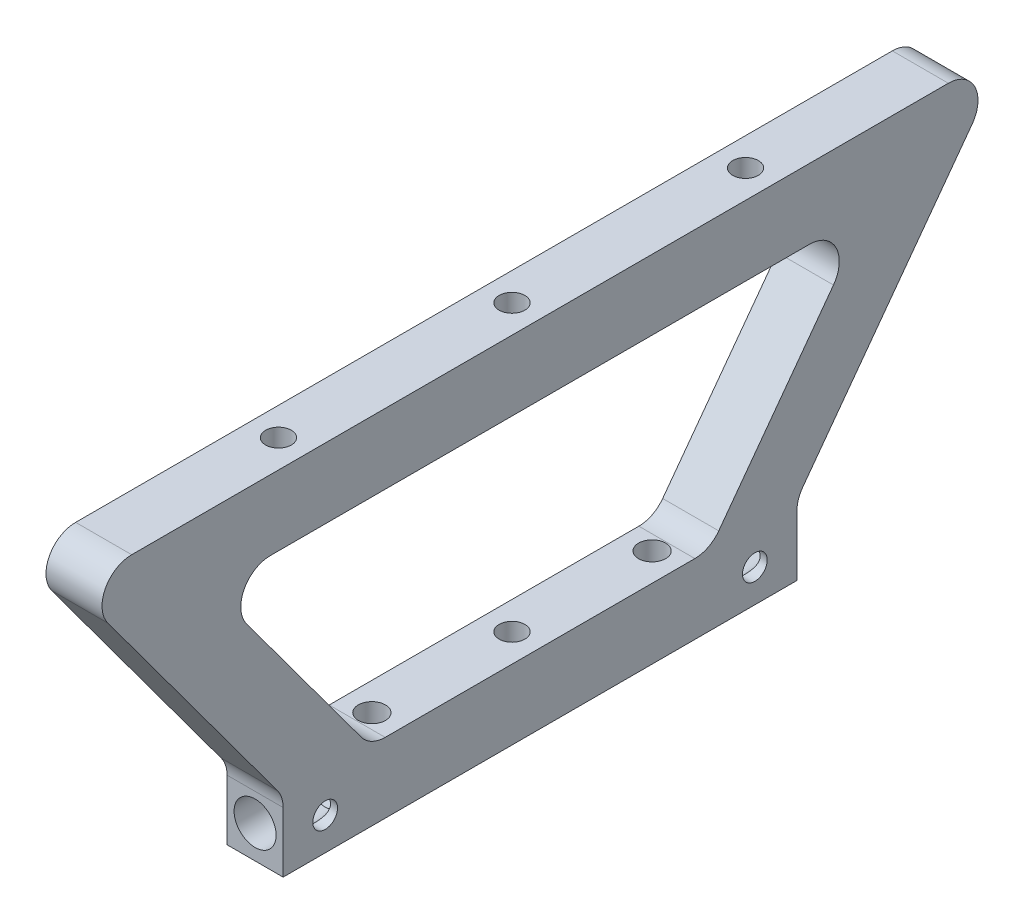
ISO-10303-21;
HEADER;
FILE_DESCRIPTION(('STEP AP214'),'2;1');
FILE_NAME('part.step','',(''),(''),'','','');
FILE_SCHEMA(('AUTOMOTIVE_DESIGN { 1 0 10303 214 1 1 1 1 }'));
ENDSEC;
DATA;
#1=APPLICATION_CONTEXT('core data for automotive mechanical design processes');
#2=APPLICATION_PROTOCOL_DEFINITION('international standard','automotive_design',2000,#1);
#3=PRODUCT_CONTEXT('',#1,'mechanical');
#4=PRODUCT('Part','Part','',(#3));
#5=PRODUCT_RELATED_PRODUCT_CATEGORY('part','',(#4));
#6=PRODUCT_DEFINITION_FORMATION('','',#4);
#7=PRODUCT_DEFINITION_CONTEXT('part definition',#1,'design');
#8=PRODUCT_DEFINITION('design','',#6,#7);
#9=PRODUCT_DEFINITION_SHAPE('','',#8);
#10=(LENGTH_UNIT() NAMED_UNIT(*) SI_UNIT(.MILLI.,.METRE.));
#11=(NAMED_UNIT(*) PLANE_ANGLE_UNIT() SI_UNIT($,.RADIAN.));
#12=(NAMED_UNIT(*) SI_UNIT($,.STERADIAN.) SOLID_ANGLE_UNIT());
#13=UNCERTAINTY_MEASURE_WITH_UNIT(LENGTH_MEASURE(1.E-05),#10,'distance_accuracy_value','');
#14=(GEOMETRIC_REPRESENTATION_CONTEXT(3) GLOBAL_UNCERTAINTY_ASSIGNED_CONTEXT((#13)) GLOBAL_UNIT_ASSIGNED_CONTEXT((#10,
#11,#12)) REPRESENTATION_CONTEXT('',''));
#15=CARTESIAN_POINT('',(0.,0.,0.));
#16=DIRECTION('',(0.,0.,1.));
#17=DIRECTION('',(1.,0.,0.));
#18=AXIS2_PLACEMENT_3D('',#15,#16,#17);
#19=CARTESIAN_POINT('',(0.,-31.0000000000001,-39.9999999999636));
#20=DIRECTION('',(0.,0.,-1.));
#21=DIRECTION('',(0.,1.,0.));
#22=AXIS2_PLACEMENT_3D('',#19,#20,#21);
#23=CONICAL_SURFACE('',#22,4.50000000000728,1.02974425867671);
#24=CARTESIAN_POINT('',(0.,-31.0000000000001,-37.2961272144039));
#25=VERTEX_POINT('',#24);
#26=VERTEX_LOOP('',#25);
#27=FACE_BOUND('',#26,.T.);
#28=CARTESIAN_POINT('',(0.,-31.0000000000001,-40.0000000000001));
#29=DIRECTION('',(0.,0.,-1.));
#30=DIRECTION('',(0.,1.,0.));
#31=AXIS2_PLACEMENT_3D('',#28,#29,#30);
#32=CIRCLE('',#31,4.49999999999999);
#33=CARTESIAN_POINT('',(0.,-26.5000000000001,-40.0000000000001));
#34=VERTEX_POINT('',#33);
#35=EDGE_CURVE('E202',#34,#34,#32,.T.);
#36=ORIENTED_EDGE('',*,*,#35,.T.);
#37=EDGE_LOOP('',(#36));
#38=FACE_BOUND('',#37,.T.);
#39=ADVANCED_FACE('F17',(#27,#38),#23,.F.);
#40=CARTESIAN_POINT('',(0.,-31.,39.9999999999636));
#41=DIRECTION('',(0.,0.,1.));
#42=DIRECTION('',(0.,-1.,0.));
#43=AXIS2_PLACEMENT_3D('',#40,#41,#42);
#44=CONICAL_SURFACE('',#43,4.50000000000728,1.02974425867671);
#45=CARTESIAN_POINT('',(0.,-31.,37.2961272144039));
#46=VERTEX_POINT('',#45);
#47=VERTEX_LOOP('',#46);
#48=FACE_BOUND('',#47,.T.);
#49=CARTESIAN_POINT('',(0.,-31.,40.));
#50=DIRECTION('',(0.,0.,1.));
#51=DIRECTION('',(0.,-1.,0.));
#52=AXIS2_PLACEMENT_3D('',#49,#50,#51);
#53=CIRCLE('',#52,4.49999999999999);
#54=CARTESIAN_POINT('',(0.,-35.5,40.));
#55=VERTEX_POINT('',#54);
#56=EDGE_CURVE('E197',#55,#55,#53,.T.);
#57=ORIENTED_EDGE('',*,*,#56,.T.);
#58=EDGE_LOOP('',(#57));
#59=FACE_BOUND('',#58,.T.);
#60=ADVANCED_FACE('F473',(#48,#59),#44,.F.);
#61=CARTESIAN_POINT('',(2.75,-33.,0.));
#62=DIRECTION('',(0.,1.,0.));
#63=DIRECTION('',(0.,0.,1.));
#64=AXIS2_PLACEMENT_3D('',#61,#62,#63);
#65=PLANE('',#64);
#66=CARTESIAN_POINT('',(0.,-33.,0.));
#67=DIRECTION('',(0.,-1.,0.));
#68=DIRECTION('',(0.,0.,-1.));
#69=AXIS2_PLACEMENT_3D('',#66,#67,#68);
#70=CIRCLE('',#69,5.);
#71=CARTESIAN_POINT('',(0.,-33.,-5.00000000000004));
#72=VERTEX_POINT('',#71);
#73=EDGE_CURVE('E205',#72,#72,#70,.T.);
#74=ORIENTED_EDGE('',*,*,#73,.T.);
#75=EDGE_LOOP('',(#74));
#76=FACE_BOUND('',#75,.T.);
#77=CARTESIAN_POINT('',(0.,-33.,0.));
#78=DIRECTION('',(0.,-1.,0.));
#79=DIRECTION('',(0.,0.,-1.));
#80=AXIS2_PLACEMENT_3D('',#77,#78,#79);
#81=CIRCLE('',#80,2.75);
#82=CARTESIAN_POINT('',(0.,-33.,-2.75000000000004));
#83=VERTEX_POINT('',#82);
#84=EDGE_CURVE('E200',#83,#83,#81,.F.);
#85=ORIENTED_EDGE('',*,*,#84,.T.);
#86=EDGE_LOOP('',(#85));
#87=FACE_BOUND('',#86,.T.);
#88=ADVANCED_FACE('F470',(#76,#87),#65,.F.);
#89=CARTESIAN_POINT('',(6.,-31.0000000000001,-46.0000000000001));
#90=DIRECTION('',(1.,0.,0.));
#91=DIRECTION('',(0.,0.,-1.));
#92=AXIS2_PLACEMENT_3D('',#89,#90,#91);
#93=CYLINDRICAL_SURFACE('',#92,2.64999999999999);
#94=CARTESIAN_POINT('',(-4.49999999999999,-31.0000000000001,-48.6500000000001));
#95=CARTESIAN_POINT('',(-4.49999422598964,-30.8640366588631,-48.6499936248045));
#96=CARTESIAN_POINT('',(-4.49376989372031,-30.7278361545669,-48.6394622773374));
#97=CARTESIAN_POINT('',(-4.46946545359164,-30.4595061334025,-48.5978641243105));
#98=CARTESIAN_POINT('',(-4.45135418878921,-30.3273882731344,-48.5667433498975));
#99=CARTESIAN_POINT('',(-4.40511499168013,-30.0716888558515,-48.485686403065));
#100=CARTESIAN_POINT('',(-4.37703637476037,-29.9480687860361,-48.4358427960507));
#101=CARTESIAN_POINT('',(-4.31327611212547,-29.7113182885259,-48.3193155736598));
#102=CARTESIAN_POINT('',(-4.27759673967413,-29.5981847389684,-48.2526369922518));
#103=CARTESIAN_POINT('',(-4.1985265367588,-29.3760250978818,-48.0987638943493));
#104=CARTESIAN_POINT('',(-4.15475833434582,-29.267940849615,-48.0104070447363));
#105=CARTESIAN_POINT('',(-4.06526883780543,-29.0672053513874,-47.8182802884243));
#106=CARTESIAN_POINT('',(-4.01954515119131,-28.9745737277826,-47.7144910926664));
#107=CARTESIAN_POINT('',(-3.92497207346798,-28.7963877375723,-47.4801137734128));
#108=CARTESIAN_POINT('',(-3.87638361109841,-28.7129321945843,-47.3478107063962));
#109=CARTESIAN_POINT('',(-3.78828463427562,-28.5697740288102,-47.0682066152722));
#110=CARTESIAN_POINT('',(-3.7487597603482,-28.510033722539,-46.9209298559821));
#111=CARTESIAN_POINT('',(-3.69293358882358,-28.4282110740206,-46.6507017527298));
#112=CARTESIAN_POINT('',(-3.6733641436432,-28.400591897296,-46.5301042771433));
#113=CARTESIAN_POINT('',(-3.64608616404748,-28.3624579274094,-46.2849742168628));
#114=CARTESIAN_POINT('',(-3.63836371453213,-28.3519230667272,-46.160446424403));
#115=CARTESIAN_POINT('',(-3.63591130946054,-28.3485559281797,-45.9108078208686));
#116=CARTESIAN_POINT('',(-3.64120359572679,-28.3557539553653,-45.7856963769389));
#117=CARTESIAN_POINT('',(-3.66402040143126,-28.3874692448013,-45.5388055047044));
#118=CARTESIAN_POINT('',(-3.68155381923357,-28.4119991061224,-45.4170285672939));
#119=CARTESIAN_POINT('',(-3.726260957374,-28.4768091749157,-45.1809300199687));
#120=CARTESIAN_POINT('',(-3.75334526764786,-28.5169436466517,-45.0665505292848));
#121=CARTESIAN_POINT('',(-3.81422869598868,-28.6115243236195,-44.8458250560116));
#122=CARTESIAN_POINT('',(-3.84803031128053,-28.6659758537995,-44.7394820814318));
#123=CARTESIAN_POINT('',(-3.92545834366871,-28.7982758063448,-44.5187318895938));
#124=CARTESIAN_POINT('',(-3.96977937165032,-28.8785242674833,-44.4060055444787));
#125=CARTESIAN_POINT('',(-4.05933541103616,-29.0553577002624,-44.1944821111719));
#126=CARTESIAN_POINT('',(-4.10457123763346,-29.1519578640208,-44.0956981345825));
#127=CARTESIAN_POINT('',(-4.19774675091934,-29.373603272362,-43.9019786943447));
#128=CARTESIAN_POINT('',(-4.24528216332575,-29.5007105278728,-43.8091845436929));
#129=CARTESIAN_POINT('',(-4.33143014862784,-29.7716520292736,-43.6465890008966));
#130=CARTESIAN_POINT('',(-4.37004869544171,-29.9154749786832,-43.5767722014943));
#131=CARTESIAN_POINT('',(-4.42777936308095,-30.1874096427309,-43.4743021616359));
#132=CARTESIAN_POINT('',(-4.44920121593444,-30.313333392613,-43.4371134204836));
#133=CARTESIAN_POINT('',(-4.48130754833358,-30.5704167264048,-43.3817682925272));
#134=CARTESIAN_POINT('',(-4.49202347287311,-30.7015597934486,-43.3635561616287));
#135=CARTESIAN_POINT('',(-4.49794142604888,-30.8610652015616,-43.3534974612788));
#136=CARTESIAN_POINT('',(-4.49871228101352,-30.8888264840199,-43.3521871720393));
#137=CARTESIAN_POINT('',(-4.4997421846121,-30.9443885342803,-43.3504377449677));
#138=CARTESIAN_POINT('',(-4.50000118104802,-30.9721893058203,-43.3499986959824));
#139=CARTESIAN_POINT('',(-4.49999422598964,-31.135963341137,-43.3500063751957));
#140=CARTESIAN_POINT('',(-4.49376989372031,-31.2721638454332,-43.3605377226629));
#141=CARTESIAN_POINT('',(-4.46946545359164,-31.5404938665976,-43.4021358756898));
#142=CARTESIAN_POINT('',(-4.4513541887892,-31.6726117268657,-43.4332566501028));
#143=CARTESIAN_POINT('',(-4.40511499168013,-31.9283111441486,-43.5143135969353));
#144=CARTESIAN_POINT('',(-4.37703637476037,-32.051931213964,-43.5641572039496));
#145=CARTESIAN_POINT('',(-4.31327611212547,-32.2886817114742,-43.6806844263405));
#146=CARTESIAN_POINT('',(-4.27759673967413,-32.4018152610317,-43.7473630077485));
#147=CARTESIAN_POINT('',(-4.19852653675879,-32.6239749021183,-43.901236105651));
#148=CARTESIAN_POINT('',(-4.15475833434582,-32.7320591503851,-43.989592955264));
#149=CARTESIAN_POINT('',(-4.06526883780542,-32.9327946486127,-44.1817197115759));
#150=CARTESIAN_POINT('',(-4.0195451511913,-33.0254262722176,-44.2855089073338));
#151=CARTESIAN_POINT('',(-3.92497207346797,-33.2036122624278,-44.5198862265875));
#152=CARTESIAN_POINT('',(-3.8763836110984,-33.2870678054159,-44.6521892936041));
#153=CARTESIAN_POINT('',(-3.7882846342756,-33.43022597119,-44.9317933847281));
#154=CARTESIAN_POINT('',(-3.74875976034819,-33.4899662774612,-45.0790701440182));
#155=CARTESIAN_POINT('',(-3.69293358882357,-33.5717889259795,-45.3492982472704));
#156=CARTESIAN_POINT('',(-3.67336414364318,-33.5994081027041,-45.469895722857));
#157=CARTESIAN_POINT('',(-3.64608616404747,-33.6375420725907,-45.7150257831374));
#158=CARTESIAN_POINT('',(-3.63836371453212,-33.6480769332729,-45.8395535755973));
#159=CARTESIAN_POINT('',(-3.63591130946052,-33.6514440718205,-46.0891921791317));
#160=CARTESIAN_POINT('',(-3.64120359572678,-33.6442460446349,-46.2143036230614));
#161=CARTESIAN_POINT('',(-3.66402040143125,-33.6125307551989,-46.4611944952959));
#162=CARTESIAN_POINT('',(-3.68155381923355,-33.5880008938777,-46.5829714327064));
#163=CARTESIAN_POINT('',(-3.72626095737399,-33.5231908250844,-46.8190699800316));
#164=CARTESIAN_POINT('',(-3.75334526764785,-33.4830563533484,-46.9334494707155));
#165=CARTESIAN_POINT('',(-3.81422869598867,-33.3884756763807,-47.1541749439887));
#166=CARTESIAN_POINT('',(-3.84803031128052,-33.3340241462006,-47.2605179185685));
#167=CARTESIAN_POINT('',(-3.9254583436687,-33.2017241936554,-47.4812681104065));
#168=CARTESIAN_POINT('',(-3.96977937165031,-33.1214757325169,-47.5939944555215));
#169=CARTESIAN_POINT('',(-4.05933541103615,-32.9446422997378,-47.8055178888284));
#170=CARTESIAN_POINT('',(-4.10457123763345,-32.8480421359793,-47.9043018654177));
#171=CARTESIAN_POINT('',(-4.19774675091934,-32.6263967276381,-48.0980213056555));
#172=CARTESIAN_POINT('',(-4.24528216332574,-32.4992894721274,-48.1908154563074));
#173=CARTESIAN_POINT('',(-4.33143014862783,-32.2283479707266,-48.3534109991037));
#174=CARTESIAN_POINT('',(-4.3700486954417,-32.084525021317,-48.4232277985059));
#175=CARTESIAN_POINT('',(-4.42777936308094,-31.8125903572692,-48.5256978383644));
#176=CARTESIAN_POINT('',(-4.44920121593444,-31.6866666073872,-48.5628865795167));
#177=CARTESIAN_POINT('',(-4.48130754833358,-31.4295832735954,-48.618231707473));
#178=CARTESIAN_POINT('',(-4.4920234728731,-31.2984402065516,-48.6364438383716));
#179=CARTESIAN_POINT('',(-4.49794142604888,-31.1389347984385,-48.6465025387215));
#180=CARTESIAN_POINT('',(-4.49871228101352,-31.1111735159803,-48.647812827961));
#181=CARTESIAN_POINT('',(-4.4997421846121,-31.0556114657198,-48.6495622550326));
#182=CARTESIAN_POINT('',(-4.50000118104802,-31.0278106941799,-48.6500013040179));
#183=CARTESIAN_POINT('',(-4.49999999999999,-31.0000000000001,-48.6500000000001));
#184=B_SPLINE_CURVE_WITH_KNOTS('',3,(#94,#95,#96,#97,#98,#99,#100,#101,#102,#103,#104,#105,#106,
#107,#108,#109,#110,#111,#112,#113,#114,#115,#116,#117,#118,#119,#120,#121,#122,#123,#124,#125,
#126,#127,#128,#129,#130,#131,#132,#133,#134,#135,#136,#137,#138,#139,#140,#141,#142,#143,#144,
#145,#146,#147,#148,#149,#150,#151,#152,#153,#154,#155,#156,#157,#158,#159,#160,#161,#162,#163,
#164,#165,#166,#167,#168,#169,#170,#171,#172,#173,#174,#175,#176,#177,#178,#179,#180,#181,#182,
#183),.UNSPECIFIED.,.T.,.F.,(4,2,2,2,2,2,2,2,2,2,2,2,2,2,2,2,2,2,2,2,2,2,2,2,2,2,2,2,2,2,2,2,2,
2,2,2,2,2,2,2,2,2,2,2,4),(0.,0.407771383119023,0.816615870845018,1.22346508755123,
1.63019279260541,2.06737501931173,2.50510835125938,2.99409833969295,3.48230818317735,
3.85647719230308,4.23020637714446,4.60457469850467,4.97921544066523,5.35043824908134,
5.72179932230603,6.15600648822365,6.59061930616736,7.08131185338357,7.57167469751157,
7.96910713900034,8.36536879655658,8.44876810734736,8.53217592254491,8.93994730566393,
9.34879179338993,9.75564101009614,10.1623687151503,10.5995509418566,11.0372842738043,
11.5262742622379,12.0144841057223,12.388653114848,12.7623822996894,13.1367506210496,
13.5113913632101,13.8826141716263,14.2539752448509,14.6881824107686,15.1227952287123,
15.6134877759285,16.1038506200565,16.5012830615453,16.8975447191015,16.9809440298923,
17.0643518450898),.UNSPECIFIED.);
#185=CARTESIAN_POINT('',(-4.49999999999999,-31.0000000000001,-48.6500000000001));
#186=VERTEX_POINT('',#185);
#187=EDGE_CURVE('E20',#186,#186,#184,.T.);
#188=ORIENTED_EDGE('',*,*,#187,.T.);
#189=EDGE_LOOP('',(#188));
#190=FACE_BOUND('',#189,.T.);
#191=CARTESIAN_POINT('',(-6.,-31.0000000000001,-46.0000000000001));
#192=DIRECTION('',(1.,0.,0.));
#193=DIRECTION('',(0.,0.,-1.));
#194=AXIS2_PLACEMENT_3D('',#191,#192,#193);
#195=CIRCLE('',#194,2.64999999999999);
#196=CARTESIAN_POINT('',(-6.,-31.0000000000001,-48.6500000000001));
#197=VERTEX_POINT('',#196);
#198=EDGE_CURVE('E451',#197,#197,#195,.T.);
#199=ORIENTED_EDGE('',*,*,#198,.F.);
#200=EDGE_LOOP('',(#199));
#201=FACE_BOUND('',#200,.T.);
#202=ADVANCED_FACE('F464',(#190,#201),#93,.F.);
#203=CARTESIAN_POINT('',(6.,-31.,46.));
#204=DIRECTION('',(1.,0.,0.));
#205=DIRECTION('',(0.,0.,-1.));
#206=AXIS2_PLACEMENT_3D('',#203,#204,#205);
#207=CYLINDRICAL_SURFACE('',#206,2.65);
#208=CARTESIAN_POINT('',(-4.49999999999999,-31.,43.35));
#209=CARTESIAN_POINT('',(-4.49999422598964,-30.864036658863,43.3500063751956));
#210=CARTESIAN_POINT('',(-4.49376989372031,-30.7278361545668,43.3605377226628));
#211=CARTESIAN_POINT('',(-4.46946545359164,-30.4595061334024,43.4021358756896));
#212=CARTESIAN_POINT('',(-4.4513541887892,-30.3273882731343,43.4332566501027));
#213=CARTESIAN_POINT('',(-4.40511499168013,-30.0716888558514,43.5143135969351));
#214=CARTESIAN_POINT('',(-4.37703637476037,-29.948068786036,43.5641572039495));
#215=CARTESIAN_POINT('',(-4.31327611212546,-29.7113182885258,43.6806844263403));
#216=CARTESIAN_POINT('',(-4.27759673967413,-29.5981847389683,43.7473630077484));
#217=CARTESIAN_POINT('',(-4.19852653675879,-29.3760250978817,43.9012361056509));
#218=CARTESIAN_POINT('',(-4.15475833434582,-29.2679408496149,43.9895929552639));
#219=CARTESIAN_POINT('',(-4.06526883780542,-29.0672053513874,44.1817197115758));
#220=CARTESIAN_POINT('',(-4.0195451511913,-28.9745737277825,44.2855089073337));
#221=CARTESIAN_POINT('',(-3.92497207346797,-28.7963877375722,44.5198862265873));
#222=CARTESIAN_POINT('',(-3.8763836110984,-28.7129321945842,44.6521892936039));
#223=CARTESIAN_POINT('',(-3.7882846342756,-28.5697740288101,44.931793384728));
#224=CARTESIAN_POINT('',(-3.74875976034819,-28.5100337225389,45.079070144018));
#225=CARTESIAN_POINT('',(-3.69293358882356,-28.4282110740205,45.3492982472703));
#226=CARTESIAN_POINT('',(-3.67336414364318,-28.4005918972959,45.4698957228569));
#227=CARTESIAN_POINT('',(-3.64608616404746,-28.3624579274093,45.7150257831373));
#228=CARTESIAN_POINT('',(-3.63836371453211,-28.3519230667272,45.8395535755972));
#229=CARTESIAN_POINT('',(-3.63591130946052,-28.3485559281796,46.0891921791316));
#230=CARTESIAN_POINT('',(-3.64120359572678,-28.3557539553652,46.2143036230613));
#231=CARTESIAN_POINT('',(-3.66402040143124,-28.3874692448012,46.4611944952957));
#232=CARTESIAN_POINT('',(-3.68155381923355,-28.4119991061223,46.5829714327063));
#233=CARTESIAN_POINT('',(-3.72626095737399,-28.4768091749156,46.8190699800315));
#234=CARTESIAN_POINT('',(-3.75334526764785,-28.5169436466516,46.9334494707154));
#235=CARTESIAN_POINT('',(-3.81422869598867,-28.6115243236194,47.1541749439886));
#236=CARTESIAN_POINT('',(-3.84803031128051,-28.6659758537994,47.2605179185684));
#237=CARTESIAN_POINT('',(-3.9254583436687,-28.7982758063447,47.4812681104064));
#238=CARTESIAN_POINT('',(-3.96977937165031,-28.8785242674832,47.5939944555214));
#239=CARTESIAN_POINT('',(-4.05933541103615,-29.0553577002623,47.8055178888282));
#240=CARTESIAN_POINT('',(-4.10457123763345,-29.1519578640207,47.9043018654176));
#241=CARTESIAN_POINT('',(-4.19774675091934,-29.3736032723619,48.0980213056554));
#242=CARTESIAN_POINT('',(-4.24528216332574,-29.5007105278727,48.1908154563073));
#243=CARTESIAN_POINT('',(-4.33143014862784,-29.7716520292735,48.3534109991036));
#244=CARTESIAN_POINT('',(-4.3700486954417,-29.9154749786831,48.4232277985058));
#245=CARTESIAN_POINT('',(-4.42777936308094,-30.1874096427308,48.5256978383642));
#246=CARTESIAN_POINT('',(-4.44920121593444,-30.3133333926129,48.5628865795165));
#247=CARTESIAN_POINT('',(-4.48130754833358,-30.5704167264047,48.6182317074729));
#248=CARTESIAN_POINT('',(-4.4920234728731,-30.7015597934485,48.6364438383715));
#249=CARTESIAN_POINT('',(-4.49794142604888,-30.8610652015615,48.6465025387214));
#250=CARTESIAN_POINT('',(-4.49871228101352,-30.8888264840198,48.6478128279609));
#251=CARTESIAN_POINT('',(-4.4997421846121,-30.9443885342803,48.6495622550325));
#252=CARTESIAN_POINT('',(-4.50000118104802,-30.9721893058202,48.6500013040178));
#253=CARTESIAN_POINT('',(-4.49999422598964,-31.135963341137,48.6499936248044));
#254=CARTESIAN_POINT('',(-4.49376989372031,-31.2721638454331,48.6394622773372));
#255=CARTESIAN_POINT('',(-4.46946545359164,-31.5404938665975,48.5978641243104));
#256=CARTESIAN_POINT('',(-4.45135418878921,-31.6726117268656,48.5667433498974));
#257=CARTESIAN_POINT('',(-4.40511499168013,-31.9283111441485,48.4856864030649));
#258=CARTESIAN_POINT('',(-4.37703637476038,-32.051931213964,48.4358427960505));
#259=CARTESIAN_POINT('',(-4.31327611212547,-32.2886817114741,48.3193155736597));
#260=CARTESIAN_POINT('',(-4.27759673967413,-32.4018152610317,48.2526369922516));
#261=CARTESIAN_POINT('',(-4.1985265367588,-32.6239749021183,48.0987638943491));
#262=CARTESIAN_POINT('',(-4.15475833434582,-32.732059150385,48.0104070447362));
#263=CARTESIAN_POINT('',(-4.06526883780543,-32.9327946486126,47.8182802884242));
#264=CARTESIAN_POINT('',(-4.01954515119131,-33.0254262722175,47.7144910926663));
#265=CARTESIAN_POINT('',(-3.92497207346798,-33.2036122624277,47.4801137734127));
#266=CARTESIAN_POINT('',(-3.87638361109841,-33.2870678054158,47.3478107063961));
#267=CARTESIAN_POINT('',(-3.78828463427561,-33.4302259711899,47.068206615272));
#268=CARTESIAN_POINT('',(-3.7487597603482,-33.4899662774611,46.920929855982));
#269=CARTESIAN_POINT('',(-3.69293358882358,-33.5717889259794,46.6507017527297));
#270=CARTESIAN_POINT('',(-3.67336414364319,-33.5994081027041,46.5301042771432));
#271=CARTESIAN_POINT('',(-3.64608616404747,-33.6375420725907,46.2849742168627));
#272=CARTESIAN_POINT('',(-3.63836371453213,-33.6480769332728,46.1604464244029));
#273=CARTESIAN_POINT('',(-3.63591130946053,-33.6514440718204,45.9108078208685));
#274=CARTESIAN_POINT('',(-3.64120359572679,-33.6442460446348,45.7856963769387));
#275=CARTESIAN_POINT('',(-3.66402040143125,-33.6125307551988,45.5388055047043));
#276=CARTESIAN_POINT('',(-3.68155381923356,-33.5880008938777,45.4170285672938));
#277=CARTESIAN_POINT('',(-3.726260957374,-33.5231908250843,45.1809300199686));
#278=CARTESIAN_POINT('',(-3.75334526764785,-33.4830563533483,45.0665505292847));
#279=CARTESIAN_POINT('',(-3.81422869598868,-33.3884756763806,44.8458250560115));
#280=CARTESIAN_POINT('',(-3.84803031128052,-33.3340241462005,44.7394820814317));
#281=CARTESIAN_POINT('',(-3.92545834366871,-33.2017241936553,44.5187318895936));
#282=CARTESIAN_POINT('',(-3.96977937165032,-33.1214757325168,44.4060055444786));
#283=CARTESIAN_POINT('',(-4.05933541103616,-32.9446422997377,44.1944821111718));
#284=CARTESIAN_POINT('',(-4.10457123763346,-32.8480421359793,44.0956981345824));
#285=CARTESIAN_POINT('',(-4.19774675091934,-32.626396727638,43.9019786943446));
#286=CARTESIAN_POINT('',(-4.24528216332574,-32.4992894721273,43.8091845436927));
#287=CARTESIAN_POINT('',(-4.33143014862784,-32.2283479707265,43.6465890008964));
#288=CARTESIAN_POINT('',(-4.37004869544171,-32.0845250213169,43.5767722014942));
#289=CARTESIAN_POINT('',(-4.42777936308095,-31.8125903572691,43.4743021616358));
#290=CARTESIAN_POINT('',(-4.44920121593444,-31.6866666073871,43.4371134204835));
#291=CARTESIAN_POINT('',(-4.48130754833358,-31.4295832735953,43.3817682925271));
#292=CARTESIAN_POINT('',(-4.49202347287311,-31.2984402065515,43.3635561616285));
#293=CARTESIAN_POINT('',(-4.49794142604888,-31.1389347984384,43.3534974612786));
#294=CARTESIAN_POINT('',(-4.49871228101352,-31.1111735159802,43.3521871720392));
#295=CARTESIAN_POINT('',(-4.4997421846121,-31.0556114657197,43.3504377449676));
#296=CARTESIAN_POINT('',(-4.50000118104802,-31.0278106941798,43.3499986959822));
#297=CARTESIAN_POINT('',(-4.49999999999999,-31.,43.35));
#298=B_SPLINE_CURVE_WITH_KNOTS('',3,(#208,#209,#210,#211,#212,#213,#214,#215,#216,#217,#218,
#219,#220,#221,#222,#223,#224,#225,#226,#227,#228,#229,#230,#231,#232,#233,#234,#235,#236,#237,
#238,#239,#240,#241,#242,#243,#244,#245,#246,#247,#248,#249,#250,#251,#252,#253,#254,#255,#256,
#257,#258,#259,#260,#261,#262,#263,#264,#265,#266,#267,#268,#269,#270,#271,#272,#273,#274,#275,
#276,#277,#278,#279,#280,#281,#282,#283,#284,#285,#286,#287,#288,#289,#290,#291,#292,#293,#294,
#295,#296,#297),.UNSPECIFIED.,.T.,.F.,(4,2,2,2,2,2,2,2,2,2,2,2,2,2,2,2,2,2,2,2,2,2,2,2,2,2,2,2,
2,2,2,2,2,2,2,2,2,2,2,2,2,2,2,2,4),(0.,0.407771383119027,0.816615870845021,1.22346508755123,
1.63019279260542,2.06737501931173,2.50510835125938,2.99409833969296,3.48230818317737,
3.85647719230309,4.23020637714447,4.60457469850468,4.97921544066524,5.35043824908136,
5.72179932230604,6.15600648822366,6.59061930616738,7.0813118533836,7.5716746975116,
7.96910713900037,8.3653687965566,8.44876810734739,8.53217592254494,8.93994730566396,
9.34879179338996,9.75564101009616,10.1623687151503,10.5995509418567,11.0372842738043,
11.5262742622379,12.0144841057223,12.388653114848,12.7623822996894,13.1367506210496,
13.5113913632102,13.8826141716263,14.253975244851,14.6881824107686,15.1227952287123,
15.6134877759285,16.1038506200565,16.5012830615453,16.8975447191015,16.9809440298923,
17.0643518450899),.UNSPECIFIED.);
#299=CARTESIAN_POINT('',(-4.49999999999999,-31.,43.35));
#300=VERTEX_POINT('',#299);
#301=EDGE_CURVE('E201',#300,#300,#298,.T.);
#302=ORIENTED_EDGE('',*,*,#301,.T.);
#303=EDGE_LOOP('',(#302));
#304=FACE_BOUND('',#303,.T.);
#305=CARTESIAN_POINT('',(-6.,-31.,46.));
#306=DIRECTION('',(1.,0.,0.));
#307=DIRECTION('',(0.,0.,-1.));
#308=AXIS2_PLACEMENT_3D('',#305,#306,#307);
#309=CIRCLE('',#308,2.65);
#310=CARTESIAN_POINT('',(-6.,-31.,43.35));
#311=VERTEX_POINT('',#310);
#312=EDGE_CURVE('E449',#311,#311,#309,.T.);
#313=ORIENTED_EDGE('',*,*,#312,.F.);
#314=EDGE_LOOP('',(#313));
#315=FACE_BOUND('',#314,.T.);
#316=ADVANCED_FACE('F441',(#304,#315),#207,.F.);
#317=CARTESIAN_POINT('',(0.,-31.0000000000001,-55.0000000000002));
#318=DIRECTION('',(0.,0.,-1.));
#319=DIRECTION('',(0.,1.,0.));
#320=AXIS2_PLACEMENT_3D('',#317,#318,#319);
#321=CYLINDRICAL_SURFACE('',#320,4.49999999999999);
#322=CARTESIAN_POINT('',(0.,-31.0000000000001,-55.0000000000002));
#323=DIRECTION('',(0.,0.,-1.));
#324=DIRECTION('',(0.,1.,0.));
#325=AXIS2_PLACEMENT_3D('',#322,#323,#324);
#326=CIRCLE('',#325,4.49999999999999);
#327=CARTESIAN_POINT('',(0.,-26.5000000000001,-55.0000000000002));
#328=VERTEX_POINT('',#327);
#329=EDGE_CURVE('E146',#328,#328,#326,.T.);
#330=ORIENTED_EDGE('',*,*,#329,.T.);
#331=EDGE_LOOP('',(#330));
#332=FACE_BOUND('',#331,.T.);
#333=ORIENTED_EDGE('',*,*,#187,.F.);
#334=EDGE_LOOP('',(#333));
#335=FACE_BOUND('',#334,.T.);
#336=ORIENTED_EDGE('',*,*,#35,.F.);
#337=EDGE_LOOP('',(#336));
#338=FACE_BOUND('',#337,.T.);
#339=CARTESIAN_POINT('',(4.49999999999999,-31.0000000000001,-48.6500000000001));
#340=CARTESIAN_POINT('',(4.49999422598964,-30.8640366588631,-48.6499936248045));
#341=CARTESIAN_POINT('',(4.49376989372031,-30.7278361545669,-48.6394622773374));
#342=CARTESIAN_POINT('',(4.46946545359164,-30.4595061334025,-48.5978641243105));
#343=CARTESIAN_POINT('',(4.45135418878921,-30.3273882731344,-48.5667433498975));
#344=CARTESIAN_POINT('',(4.40511499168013,-30.0716888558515,-48.485686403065));
#345=CARTESIAN_POINT('',(4.37703637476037,-29.9480687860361,-48.4358427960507));
#346=CARTESIAN_POINT('',(4.31327611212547,-29.7113182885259,-48.3193155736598));
#347=CARTESIAN_POINT('',(4.27759673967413,-29.5981847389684,-48.2526369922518));
#348=CARTESIAN_POINT('',(4.1985265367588,-29.3760250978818,-48.0987638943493));
#349=CARTESIAN_POINT('',(4.15475833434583,-29.267940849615,-48.0104070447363));
#350=CARTESIAN_POINT('',(4.06526883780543,-29.0672053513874,-47.8182802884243));
#351=CARTESIAN_POINT('',(4.01954515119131,-28.9745737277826,-47.7144910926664));
#352=CARTESIAN_POINT('',(3.92497207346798,-28.7963877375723,-47.4801137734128));
#353=CARTESIAN_POINT('',(3.87638361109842,-28.7129321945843,-47.3478107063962));
#354=CARTESIAN_POINT('',(3.78828463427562,-28.5697740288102,-47.0682066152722));
#355=CARTESIAN_POINT('',(3.7487597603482,-28.510033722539,-46.9209298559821));
#356=CARTESIAN_POINT('',(3.69293358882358,-28.4282110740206,-46.6507017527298));
#357=CARTESIAN_POINT('',(3.6733641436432,-28.400591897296,-46.5301042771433));
#358=CARTESIAN_POINT('',(3.64608616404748,-28.3624579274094,-46.2849742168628));
#359=CARTESIAN_POINT('',(3.63836371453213,-28.3519230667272,-46.160446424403));
#360=CARTESIAN_POINT('',(3.63591130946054,-28.3485559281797,-45.9108078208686));
#361=CARTESIAN_POINT('',(3.64120359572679,-28.3557539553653,-45.7856963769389));
#362=CARTESIAN_POINT('',(3.66402040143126,-28.3874692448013,-45.5388055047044));
#363=CARTESIAN_POINT('',(3.68155381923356,-28.4119991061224,-45.4170285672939));
#364=CARTESIAN_POINT('',(3.726260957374,-28.4768091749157,-45.1809300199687));
#365=CARTESIAN_POINT('',(3.75334526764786,-28.5169436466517,-45.0665505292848));
#366=CARTESIAN_POINT('',(3.81422869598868,-28.6115243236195,-44.8458250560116));
#367=CARTESIAN_POINT('',(3.84803031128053,-28.6659758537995,-44.7394820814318));
#368=CARTESIAN_POINT('',(3.92545834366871,-28.7982758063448,-44.5187318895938));
#369=CARTESIAN_POINT('',(3.96977937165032,-28.8785242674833,-44.4060055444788));
#370=CARTESIAN_POINT('',(4.05933541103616,-29.0553577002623,-44.1944821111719));
#371=CARTESIAN_POINT('',(4.10457123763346,-29.1519578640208,-44.0956981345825));
#372=CARTESIAN_POINT('',(4.19774675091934,-29.373603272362,-43.9019786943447));
#373=CARTESIAN_POINT('',(4.24528216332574,-29.5007105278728,-43.8091845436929));
#374=CARTESIAN_POINT('',(4.33143014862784,-29.7716520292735,-43.6465890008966));
#375=CARTESIAN_POINT('',(4.37004869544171,-29.9154749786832,-43.5767722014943));
#376=CARTESIAN_POINT('',(4.42777936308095,-30.1874096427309,-43.4743021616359));
#377=CARTESIAN_POINT('',(4.44920121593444,-30.313333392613,-43.4371134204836));
#378=CARTESIAN_POINT('',(4.48130754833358,-30.5704167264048,-43.3817682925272));
#379=CARTESIAN_POINT('',(4.49202347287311,-30.7015597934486,-43.3635561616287));
#380=CARTESIAN_POINT('',(4.49794142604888,-30.8610652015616,-43.3534974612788));
#381=CARTESIAN_POINT('',(4.49871228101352,-30.8888264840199,-43.3521871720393));
#382=CARTESIAN_POINT('',(4.4997421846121,-30.9443885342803,-43.3504377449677));
#383=CARTESIAN_POINT('',(4.50000118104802,-30.9721893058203,-43.3499986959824));
#384=CARTESIAN_POINT('',(4.49999422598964,-31.135963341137,-43.3500063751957));
#385=CARTESIAN_POINT('',(4.49376989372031,-31.2721638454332,-43.3605377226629));
#386=CARTESIAN_POINT('',(4.46946545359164,-31.5404938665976,-43.4021358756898));
#387=CARTESIAN_POINT('',(4.45135418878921,-31.6726117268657,-43.4332566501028));
#388=CARTESIAN_POINT('',(4.40511499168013,-31.9283111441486,-43.5143135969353));
#389=CARTESIAN_POINT('',(4.37703637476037,-32.051931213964,-43.5641572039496));
#390=CARTESIAN_POINT('',(4.31327611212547,-32.2886817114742,-43.6806844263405));
#391=CARTESIAN_POINT('',(4.27759673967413,-32.4018152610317,-43.7473630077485));
#392=CARTESIAN_POINT('',(4.19852653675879,-32.6239749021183,-43.901236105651));
#393=CARTESIAN_POINT('',(4.15475833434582,-32.7320591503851,-43.989592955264));
#394=CARTESIAN_POINT('',(4.06526883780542,-32.9327946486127,-44.1817197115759));
#395=CARTESIAN_POINT('',(4.0195451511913,-33.0254262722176,-44.2855089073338));
#396=CARTESIAN_POINT('',(3.92497207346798,-33.2036122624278,-44.5198862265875));
#397=CARTESIAN_POINT('',(3.87638361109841,-33.2870678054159,-44.6521892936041));
#398=CARTESIAN_POINT('',(3.78828463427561,-33.43022597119,-44.9317933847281));
#399=CARTESIAN_POINT('',(3.74875976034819,-33.4899662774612,-45.0790701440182));
#400=CARTESIAN_POINT('',(3.69293358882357,-33.5717889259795,-45.3492982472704));
#401=CARTESIAN_POINT('',(3.67336414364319,-33.5994081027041,-45.469895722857));
#402=CARTESIAN_POINT('',(3.64608616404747,-33.6375420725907,-45.7150257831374));
#403=CARTESIAN_POINT('',(3.63836371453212,-33.6480769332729,-45.8395535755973));
#404=CARTESIAN_POINT('',(3.63591130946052,-33.6514440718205,-46.0891921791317));
#405=CARTESIAN_POINT('',(3.64120359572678,-33.6442460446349,-46.2143036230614));
#406=CARTESIAN_POINT('',(3.66402040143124,-33.6125307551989,-46.4611944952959));
#407=CARTESIAN_POINT('',(3.68155381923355,-33.5880008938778,-46.5829714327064));
#408=CARTESIAN_POINT('',(3.72626095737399,-33.5231908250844,-46.8190699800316));
#409=CARTESIAN_POINT('',(3.75334526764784,-33.4830563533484,-46.9334494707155));
#410=CARTESIAN_POINT('',(3.81422869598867,-33.3884756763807,-47.1541749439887));
#411=CARTESIAN_POINT('',(3.84803031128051,-33.3340241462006,-47.2605179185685));
#412=CARTESIAN_POINT('',(3.92545834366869,-33.2017241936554,-47.4812681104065));
#413=CARTESIAN_POINT('',(3.96977937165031,-33.1214757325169,-47.5939944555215));
#414=CARTESIAN_POINT('',(4.05933541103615,-32.9446422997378,-47.8055178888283));
#415=CARTESIAN_POINT('',(4.10457123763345,-32.8480421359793,-47.9043018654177));
#416=CARTESIAN_POINT('',(4.19774675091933,-32.6263967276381,-48.0980213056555));
#417=CARTESIAN_POINT('',(4.24528216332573,-32.4992894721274,-48.1908154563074));
#418=CARTESIAN_POINT('',(4.33143014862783,-32.2283479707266,-48.3534109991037));
#419=CARTESIAN_POINT('',(4.3700486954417,-32.084525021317,-48.4232277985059));
#420=CARTESIAN_POINT('',(4.42777936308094,-31.8125903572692,-48.5256978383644));
#421=CARTESIAN_POINT('',(4.44920121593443,-31.6866666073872,-48.5628865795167));
#422=CARTESIAN_POINT('',(4.48130754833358,-31.4295832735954,-48.618231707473));
#423=CARTESIAN_POINT('',(4.4920234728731,-31.2984402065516,-48.6364438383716));
#424=CARTESIAN_POINT('',(4.49794142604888,-31.1389347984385,-48.6465025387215));
#425=CARTESIAN_POINT('',(4.49871228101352,-31.1111735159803,-48.647812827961));
#426=CARTESIAN_POINT('',(4.4997421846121,-31.0556114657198,-48.6495622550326));
#427=CARTESIAN_POINT('',(4.50000118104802,-31.0278106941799,-48.6500013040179));
#428=CARTESIAN_POINT('',(4.49999999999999,-31.0000000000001,-48.6500000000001));
#429=B_SPLINE_CURVE_WITH_KNOTS('',3,(#339,#340,#341,#342,#343,#344,#345,#346,#347,#348,#349,
#350,#351,#352,#353,#354,#355,#356,#357,#358,#359,#360,#361,#362,#363,#364,#365,#366,#367,#368,
#369,#370,#371,#372,#373,#374,#375,#376,#377,#378,#379,#380,#381,#382,#383,#384,#385,#386,#387,
#388,#389,#390,#391,#392,#393,#394,#395,#396,#397,#398,#399,#400,#401,#402,#403,#404,#405,#406,
#407,#408,#409,#410,#411,#412,#413,#414,#415,#416,#417,#418,#419,#420,#421,#422,#423,#424,#425,
#426,#427,#428),.UNSPECIFIED.,.T.,.F.,(4,2,2,2,2,2,2,2,2,2,2,2,2,2,2,2,2,2,2,2,2,2,2,2,2,2,2,2,
2,2,2,2,2,2,2,2,2,2,2,2,2,2,2,2,4),(0.,0.407771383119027,0.816615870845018,1.22346508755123,
1.63019279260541,2.06737501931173,2.50510835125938,2.99409833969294,3.48230818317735,
3.85647719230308,4.23020637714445,4.60457469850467,4.97921544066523,5.35043824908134,
5.72179932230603,6.15600648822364,6.59061930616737,7.08131185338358,7.57167469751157,
7.96910713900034,8.36536879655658,8.44876810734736,8.53217592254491,8.93994730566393,
9.34879179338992,9.75564101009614,10.1623687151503,10.5995509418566,11.0372842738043,
11.5262742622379,12.0144841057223,12.388653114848,12.7623822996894,13.1367506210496,
13.5113913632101,13.8826141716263,14.2539752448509,14.6881824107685,15.1227952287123,
15.6134877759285,16.1038506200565,16.5012830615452,16.8975447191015,16.9809440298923,
17.0643518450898),.UNSPECIFIED.);
#430=CARTESIAN_POINT('',(4.49999999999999,-31.0000000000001,-48.6500000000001));
#431=VERTEX_POINT('',#430);
#432=EDGE_CURVE('E305',#431,#431,#429,.T.);
#433=ORIENTED_EDGE('',*,*,#432,.T.);
#434=EDGE_LOOP('',(#433));
#435=FACE_BOUND('',#434,.T.);
#436=ADVANCED_FACE('F438',(#332,#335,#338,#435),#321,.F.);
#437=CARTESIAN_POINT('',(0.,-38.,0.));
#438=DIRECTION('',(0.,-1.,0.));
#439=DIRECTION('',(0.,0.,-1.));
#440=AXIS2_PLACEMENT_3D('',#437,#438,#439);
#441=CYLINDRICAL_SURFACE('',#440,5.);
#442=ORIENTED_EDGE('',*,*,#73,.F.);
#443=EDGE_LOOP('',(#442));
#444=FACE_BOUND('',#443,.T.);
#445=CARTESIAN_POINT('',(0.,-38.,0.));
#446=DIRECTION('',(0.,-1.,0.));
#447=DIRECTION('',(0.,0.,-1.));
#448=AXIS2_PLACEMENT_3D('',#445,#446,#447);
#449=CIRCLE('',#448,5.);
#450=CARTESIAN_POINT('',(0.,-38.,-5.00000000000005));
#451=VERTEX_POINT('',#450);
#452=EDGE_CURVE('E194',#451,#451,#449,.T.);
#453=ORIENTED_EDGE('',*,*,#452,.T.);
#454=EDGE_LOOP('',(#453));
#455=FACE_BOUND('',#454,.T.);
#456=ADVANCED_FACE('F354',(#444,#455),#441,.F.);
#457=CARTESIAN_POINT('',(0.,-31.,55.));
#458=DIRECTION('',(0.,0.,1.));
#459=DIRECTION('',(0.,-1.,0.));
#460=AXIS2_PLACEMENT_3D('',#457,#458,#459);
#461=CYLINDRICAL_SURFACE('',#460,4.49999999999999);
#462=CARTESIAN_POINT('',(0.,-31.,55.));
#463=DIRECTION('',(0.,0.,1.));
#464=DIRECTION('',(0.,-1.,0.));
#465=AXIS2_PLACEMENT_3D('',#462,#463,#464);
#466=CIRCLE('',#465,4.49999999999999);
#467=CARTESIAN_POINT('',(0.,-35.5,55.));
#468=VERTEX_POINT('',#467);
#469=EDGE_CURVE('E287',#468,#468,#466,.T.);
#470=ORIENTED_EDGE('',*,*,#469,.T.);
#471=EDGE_LOOP('',(#470));
#472=FACE_BOUND('',#471,.T.);
#473=CARTESIAN_POINT('',(4.49999999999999,-31.,43.35));
#474=CARTESIAN_POINT('',(4.49999422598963,-30.864036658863,43.3500063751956));
#475=CARTESIAN_POINT('',(4.49376989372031,-30.7278361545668,43.3605377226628));
#476=CARTESIAN_POINT('',(4.46946545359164,-30.4595061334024,43.4021358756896));
#477=CARTESIAN_POINT('',(4.4513541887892,-30.3273882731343,43.4332566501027));
#478=CARTESIAN_POINT('',(4.40511499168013,-30.0716888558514,43.5143135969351));
#479=CARTESIAN_POINT('',(4.37703637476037,-29.948068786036,43.5641572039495));
#480=CARTESIAN_POINT('',(4.31327611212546,-29.7113182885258,43.6806844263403));
#481=CARTESIAN_POINT('',(4.27759673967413,-29.5981847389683,43.7473630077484));
#482=CARTESIAN_POINT('',(4.19852653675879,-29.3760250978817,43.9012361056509));
#483=CARTESIAN_POINT('',(4.15475833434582,-29.2679408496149,43.9895929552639));
#484=CARTESIAN_POINT('',(4.06526883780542,-29.0672053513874,44.1817197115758));
#485=CARTESIAN_POINT('',(4.0195451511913,-28.9745737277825,44.2855089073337));
#486=CARTESIAN_POINT('',(3.92497207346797,-28.7963877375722,44.5198862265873));
#487=CARTESIAN_POINT('',(3.8763836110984,-28.7129321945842,44.6521892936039));
#488=CARTESIAN_POINT('',(3.7882846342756,-28.5697740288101,44.931793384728));
#489=CARTESIAN_POINT('',(3.74875976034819,-28.5100337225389,45.079070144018));
#490=CARTESIAN_POINT('',(3.69293358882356,-28.4282110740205,45.3492982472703));
#491=CARTESIAN_POINT('',(3.67336414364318,-28.4005918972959,45.4698957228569));
#492=CARTESIAN_POINT('',(3.64608616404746,-28.3624579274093,45.7150257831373));
#493=CARTESIAN_POINT('',(3.63836371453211,-28.3519230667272,45.8395535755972));
#494=CARTESIAN_POINT('',(3.63591130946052,-28.3485559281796,46.0891921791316));
#495=CARTESIAN_POINT('',(3.64120359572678,-28.3557539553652,46.2143036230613));
#496=CARTESIAN_POINT('',(3.66402040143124,-28.3874692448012,46.4611944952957));
#497=CARTESIAN_POINT('',(3.68155381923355,-28.4119991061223,46.5829714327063));
#498=CARTESIAN_POINT('',(3.72626095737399,-28.4768091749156,46.8190699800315));
#499=CARTESIAN_POINT('',(3.75334526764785,-28.5169436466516,46.9334494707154));
#500=CARTESIAN_POINT('',(3.81422869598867,-28.6115243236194,47.1541749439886));
#501=CARTESIAN_POINT('',(3.84803031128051,-28.6659758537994,47.2605179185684));
#502=CARTESIAN_POINT('',(3.9254583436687,-28.7982758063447,47.4812681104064));
#503=CARTESIAN_POINT('',(3.96977937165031,-28.8785242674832,47.5939944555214));
#504=CARTESIAN_POINT('',(4.05933541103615,-29.0553577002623,47.8055178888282));
#505=CARTESIAN_POINT('',(4.10457123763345,-29.1519578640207,47.9043018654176));
#506=CARTESIAN_POINT('',(4.19774675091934,-29.3736032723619,48.0980213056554));
#507=CARTESIAN_POINT('',(4.24528216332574,-29.5007105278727,48.1908154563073));
#508=CARTESIAN_POINT('',(4.33143014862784,-29.7716520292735,48.3534109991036));
#509=CARTESIAN_POINT('',(4.3700486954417,-29.9154749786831,48.4232277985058));
#510=CARTESIAN_POINT('',(4.42777936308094,-30.1874096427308,48.5256978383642));
#511=CARTESIAN_POINT('',(4.44920121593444,-30.3133333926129,48.5628865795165));
#512=CARTESIAN_POINT('',(4.48130754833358,-30.5704167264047,48.6182317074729));
#513=CARTESIAN_POINT('',(4.4920234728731,-30.7015597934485,48.6364438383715));
#514=CARTESIAN_POINT('',(4.49794142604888,-30.8610652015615,48.6465025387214));
#515=CARTESIAN_POINT('',(4.49871228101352,-30.8888264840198,48.6478128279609));
#516=CARTESIAN_POINT('',(4.4997421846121,-30.9443885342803,48.6495622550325));
#517=CARTESIAN_POINT('',(4.50000118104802,-30.9721893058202,48.6500013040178));
#518=CARTESIAN_POINT('',(4.49999422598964,-31.135963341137,48.6499936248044));
#519=CARTESIAN_POINT('',(4.49376989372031,-31.2721638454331,48.6394622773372));
#520=CARTESIAN_POINT('',(4.46946545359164,-31.5404938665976,48.5978641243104));
#521=CARTESIAN_POINT('',(4.4513541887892,-31.6726117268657,48.5667433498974));
#522=CARTESIAN_POINT('',(4.40511499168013,-31.9283111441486,48.4856864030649));
#523=CARTESIAN_POINT('',(4.37703637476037,-32.051931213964,48.4358427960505));
#524=CARTESIAN_POINT('',(4.31327611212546,-32.2886817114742,48.3193155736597));
#525=CARTESIAN_POINT('',(4.27759673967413,-32.4018152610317,48.2526369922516));
#526=CARTESIAN_POINT('',(4.19852653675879,-32.6239749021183,48.0987638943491));
#527=CARTESIAN_POINT('',(4.15475833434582,-32.7320591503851,48.0104070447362));
#528=CARTESIAN_POINT('',(4.06526883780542,-32.9327946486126,47.8182802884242));
#529=CARTESIAN_POINT('',(4.0195451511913,-33.0254262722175,47.7144910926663));
#530=CARTESIAN_POINT('',(3.92497207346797,-33.2036122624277,47.4801137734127));
#531=CARTESIAN_POINT('',(3.87638361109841,-33.2870678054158,47.3478107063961));
#532=CARTESIAN_POINT('',(3.78828463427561,-33.4302259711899,47.068206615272));
#533=CARTESIAN_POINT('',(3.74875976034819,-33.4899662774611,46.920929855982));
#534=CARTESIAN_POINT('',(3.69293358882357,-33.5717889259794,46.6507017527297));
#535=CARTESIAN_POINT('',(3.67336414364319,-33.5994081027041,46.5301042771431));
#536=CARTESIAN_POINT('',(3.64608616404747,-33.6375420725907,46.2849742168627));
#537=CARTESIAN_POINT('',(3.63836371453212,-33.6480769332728,46.1604464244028));
#538=CARTESIAN_POINT('',(3.63591130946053,-33.6514440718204,45.9108078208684));
#539=CARTESIAN_POINT('',(3.64120359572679,-33.6442460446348,45.7856963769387));
#540=CARTESIAN_POINT('',(3.66402040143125,-33.6125307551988,45.5388055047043));
#541=CARTESIAN_POINT('',(3.68155381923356,-33.5880008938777,45.4170285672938));
#542=CARTESIAN_POINT('',(3.726260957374,-33.5231908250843,45.1809300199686));
#543=CARTESIAN_POINT('',(3.75334526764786,-33.4830563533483,45.0665505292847));
#544=CARTESIAN_POINT('',(3.81422869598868,-33.3884756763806,44.8458250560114));
#545=CARTESIAN_POINT('',(3.84803031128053,-33.3340241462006,44.7394820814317));
#546=CARTESIAN_POINT('',(3.92545834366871,-33.2017241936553,44.5187318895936));
#547=CARTESIAN_POINT('',(3.96977937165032,-33.1214757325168,44.4060055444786));
#548=CARTESIAN_POINT('',(4.05933541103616,-32.9446422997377,44.1944821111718));
#549=CARTESIAN_POINT('',(4.10457123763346,-32.8480421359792,44.0956981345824));
#550=CARTESIAN_POINT('',(4.19774675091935,-32.626396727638,43.9019786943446));
#551=CARTESIAN_POINT('',(4.24528216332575,-32.4992894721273,43.8091845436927));
#552=CARTESIAN_POINT('',(4.33143014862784,-32.2283479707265,43.6465890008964));
#553=CARTESIAN_POINT('',(4.37004869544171,-32.0845250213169,43.5767722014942));
#554=CARTESIAN_POINT('',(4.42777936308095,-31.8125903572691,43.4743021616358));
#555=CARTESIAN_POINT('',(4.44920121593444,-31.6866666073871,43.4371134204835));
#556=CARTESIAN_POINT('',(4.48130754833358,-31.4295832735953,43.3817682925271));
#557=CARTESIAN_POINT('',(4.49202347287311,-31.2984402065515,43.3635561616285));
#558=CARTESIAN_POINT('',(4.49794142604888,-31.1389347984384,43.3534974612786));
#559=CARTESIAN_POINT('',(4.49871228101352,-31.1111735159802,43.3521871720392));
#560=CARTESIAN_POINT('',(4.4997421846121,-31.0556114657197,43.3504377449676));
#561=CARTESIAN_POINT('',(4.50000118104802,-31.0278106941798,43.3499986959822));
#562=CARTESIAN_POINT('',(4.49999999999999,-31.,43.35));
#563=B_SPLINE_CURVE_WITH_KNOTS('',3,(#473,#474,#475,#476,#477,#478,#479,#480,#481,#482,#483,
#484,#485,#486,#487,#488,#489,#490,#491,#492,#493,#494,#495,#496,#497,#498,#499,#500,#501,#502,
#503,#504,#505,#506,#507,#508,#509,#510,#511,#512,#513,#514,#515,#516,#517,#518,#519,#520,#521,
#522,#523,#524,#525,#526,#527,#528,#529,#530,#531,#532,#533,#534,#535,#536,#537,#538,#539,#540,
#541,#542,#543,#544,#545,#546,#547,#548,#549,#550,#551,#552,#553,#554,#555,#556,#557,#558,#559,
#560,#561,#562),.UNSPECIFIED.,.T.,.F.,(4,2,2,2,2,2,2,2,2,2,2,2,2,2,2,2,2,2,2,2,2,2,2,2,2,2,2,2,
2,2,2,2,2,2,2,2,2,2,2,2,2,2,2,2,4),(0.,0.407771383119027,0.816615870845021,1.22346508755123,
1.63019279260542,2.06737501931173,2.50510835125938,2.99409833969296,3.48230818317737,
3.85647719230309,4.23020637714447,4.60457469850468,4.97921544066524,5.35043824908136,
5.72179932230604,6.15600648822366,6.59061930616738,7.0813118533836,7.5716746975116,
7.96910713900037,8.3653687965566,8.44876810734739,8.53217592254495,8.93994730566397,
9.34879179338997,9.75564101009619,10.1623687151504,10.5995509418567,11.0372842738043,
11.5262742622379,12.0144841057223,12.388653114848,12.7623822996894,13.1367506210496,
13.5113913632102,13.8826141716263,14.253975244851,14.6881824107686,15.1227952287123,
15.6134877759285,16.1038506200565,16.5012830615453,16.8975447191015,16.9809440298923,
17.0643518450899),.UNSPECIFIED.);
#564=CARTESIAN_POINT('',(4.49999999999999,-31.,43.35));
#565=VERTEX_POINT('',#564);
#566=EDGE_CURVE('E147',#565,#565,#563,.T.);
#567=ORIENTED_EDGE('',*,*,#566,.T.);
#568=EDGE_LOOP('',(#567));
#569=FACE_BOUND('',#568,.T.);
#570=ORIENTED_EDGE('',*,*,#56,.F.);
#571=EDGE_LOOP('',(#570));
#572=FACE_BOUND('',#571,.T.);
#573=ORIENTED_EDGE('',*,*,#301,.F.);
#574=EDGE_LOOP('',(#573));
#575=FACE_BOUND('',#574,.T.);
#576=ADVANCED_FACE('F310',(#472,#569,#572,#575),#461,.F.);
#577=CARTESIAN_POINT('',(0.,-38.,0.));
#578=DIRECTION('',(0.,-1.,0.));
#579=DIRECTION('',(0.,0.,-1.));
#580=AXIS2_PLACEMENT_3D('',#577,#578,#579);
#581=CYLINDRICAL_SURFACE('',#580,2.75);
#582=CARTESIAN_POINT('',(0.,-23.,0.));
#583=DIRECTION('',(0.,-1.,0.));
#584=DIRECTION('',(0.,0.,-1.));
#585=AXIS2_PLACEMENT_3D('',#582,#583,#584);
#586=CIRCLE('',#585,2.75);
#587=CARTESIAN_POINT('',(0.,-23.,-2.75000000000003));
#588=VERTEX_POINT('',#587);
#589=EDGE_CURVE('E269',#588,#588,#586,.T.);
#590=ORIENTED_EDGE('',*,*,#589,.F.);
#591=EDGE_LOOP('',(#590));
#592=FACE_BOUND('',#591,.T.);
#593=ORIENTED_EDGE('',*,*,#84,.F.);
#594=EDGE_LOOP('',(#593));
#595=FACE_BOUND('',#594,.T.);
#596=ADVANCED_FACE('F346',(#592,#595),#581,.F.);
#597=CARTESIAN_POINT('',(0.,-38.,30.));
#598=DIRECTION('',(0.,-1.,0.));
#599=DIRECTION('',(0.,0.,-1.));
#600=AXIS2_PLACEMENT_3D('',#597,#598,#599);
#601=CYLINDRICAL_SURFACE('',#600,2.9);
#602=CARTESIAN_POINT('',(0.,-23.,30.));
#603=DIRECTION('',(0.,-1.,0.));
#604=DIRECTION('',(0.,0.,-1.));
#605=AXIS2_PLACEMENT_3D('',#602,#603,#604);
#606=CIRCLE('',#605,2.9);
#607=CARTESIAN_POINT('',(0.,-23.,27.1));
#608=VERTEX_POINT('',#607);
#609=EDGE_CURVE('E266',#608,#608,#606,.T.);
#610=ORIENTED_EDGE('',*,*,#609,.F.);
#611=EDGE_LOOP('',(#610));
#612=FACE_BOUND('',#611,.T.);
#613=CARTESIAN_POINT('',(0.,-38.,30.));
#614=DIRECTION('',(0.,-1.,0.));
#615=DIRECTION('',(0.,0.,-1.));
#616=AXIS2_PLACEMENT_3D('',#613,#614,#615);
#617=CIRCLE('',#616,2.9);
#618=CARTESIAN_POINT('',(0.,-38.,27.1));
#619=VERTEX_POINT('',#618);
#620=EDGE_CURVE('E290',#619,#619,#617,.T.);
#621=ORIENTED_EDGE('',*,*,#620,.T.);
#622=EDGE_LOOP('',(#621));
#623=FACE_BOUND('',#622,.T.);
#624=ADVANCED_FACE('F343',(#612,#623),#601,.F.);
#625=CARTESIAN_POINT('',(0.,-38.0000000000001,-30.0000000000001));
#626=DIRECTION('',(0.,-1.,0.));
#627=DIRECTION('',(0.,0.,-1.));
#628=AXIS2_PLACEMENT_3D('',#625,#626,#627);
#629=CYLINDRICAL_SURFACE('',#628,2.9);
#630=CARTESIAN_POINT('',(0.,-23.,-30.0000000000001));
#631=DIRECTION('',(0.,-1.,0.));
#632=DIRECTION('',(0.,0.,-1.));
#633=AXIS2_PLACEMENT_3D('',#630,#631,#632);
#634=CIRCLE('',#633,2.9);
#635=CARTESIAN_POINT('',(0.,-23.,-32.9000000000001));
#636=VERTEX_POINT('',#635);
#637=EDGE_CURVE('E263',#636,#636,#634,.T.);
#638=ORIENTED_EDGE('',*,*,#637,.F.);
#639=EDGE_LOOP('',(#638));
#640=FACE_BOUND('',#639,.T.);
#641=CARTESIAN_POINT('',(0.,-38.0000000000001,-30.0000000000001));
#642=DIRECTION('',(0.,-1.,0.));
#643=DIRECTION('',(0.,0.,-1.));
#644=AXIS2_PLACEMENT_3D('',#641,#642,#643);
#645=CIRCLE('',#644,2.9);
#646=CARTESIAN_POINT('',(0.,-38.0000000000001,-32.9000000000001));
#647=VERTEX_POINT('',#646);
#648=EDGE_CURVE('E188',#647,#647,#645,.T.);
#649=ORIENTED_EDGE('',*,*,#648,.T.);
#650=EDGE_LOOP('',(#649));
#651=FACE_BOUND('',#650,.T.);
#652=ADVANCED_FACE('F339',(#640,#651),#629,.F.);
#653=CARTESIAN_POINT('',(0.,38.0000000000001,50.0000000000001));
#654=DIRECTION('',(0.,1.,0.));
#655=DIRECTION('',(0.,0.,1.));
#656=AXIS2_PLACEMENT_3D('',#653,#654,#655);
#657=CYLINDRICAL_SURFACE('',#656,2.75);
#658=CARTESIAN_POINT('',(0.,23.0000000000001,50.0000000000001));
#659=DIRECTION('',(0.,1.,0.));
#660=DIRECTION('',(0.,0.,1.));
#661=AXIS2_PLACEMENT_3D('',#658,#659,#660);
#662=CIRCLE('',#661,2.75);
#663=CARTESIAN_POINT('',(0.,23.0000000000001,52.7500000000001));
#664=VERTEX_POINT('',#663);
#665=EDGE_CURVE('E251',#664,#664,#662,.T.);
#666=ORIENTED_EDGE('',*,*,#665,.F.);
#667=EDGE_LOOP('',(#666));
#668=FACE_BOUND('',#667,.T.);
#669=CARTESIAN_POINT('',(0.,38.0000000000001,50.0000000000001));
#670=DIRECTION('',(0.,1.,0.));
#671=DIRECTION('',(0.,0.,1.));
#672=AXIS2_PLACEMENT_3D('',#669,#670,#671);
#673=CIRCLE('',#672,2.75);
#674=CARTESIAN_POINT('',(0.,38.0000000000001,52.7500000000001));
#675=VERTEX_POINT('',#674);
#676=EDGE_CURVE('E173',#675,#675,#673,.T.);
#677=ORIENTED_EDGE('',*,*,#676,.T.);
#678=EDGE_LOOP('',(#677));
#679=FACE_BOUND('',#678,.T.);
#680=ADVANCED_FACE('F335',(#668,#679),#657,.F.);
#681=CARTESIAN_POINT('',(0.,38.,0.));
#682=DIRECTION('',(0.,1.,0.));
#683=DIRECTION('',(0.,0.,1.));
#684=AXIS2_PLACEMENT_3D('',#681,#682,#683);
#685=CYLINDRICAL_SURFACE('',#684,2.75);
#686=CARTESIAN_POINT('',(0.,23.,0.));
#687=DIRECTION('',(0.,1.,0.));
#688=DIRECTION('',(0.,0.,1.));
#689=AXIS2_PLACEMENT_3D('',#686,#687,#688);
#690=CIRCLE('',#689,2.75);
#691=CARTESIAN_POINT('',(0.,23.,2.75000000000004));
#692=VERTEX_POINT('',#691);
#693=EDGE_CURVE('E248',#692,#692,#690,.T.);
#694=ORIENTED_EDGE('',*,*,#693,.F.);
#695=EDGE_LOOP('',(#694));
#696=FACE_BOUND('',#695,.T.);
#697=CARTESIAN_POINT('',(0.,38.,0.));
#698=DIRECTION('',(0.,1.,0.));
#699=DIRECTION('',(0.,0.,1.));
#700=AXIS2_PLACEMENT_3D('',#697,#698,#699);
#701=CIRCLE('',#700,2.75);
#702=CARTESIAN_POINT('',(0.,38.,2.75000000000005));
#703=VERTEX_POINT('',#702);
#704=EDGE_CURVE('E280',#703,#703,#701,.T.);
#705=ORIENTED_EDGE('',*,*,#704,.T.);
#706=EDGE_LOOP('',(#705));
#707=FACE_BOUND('',#706,.T.);
#708=ADVANCED_FACE('F331',(#696,#707),#685,.F.);
#709=CARTESIAN_POINT('',(0.,38.,-50.));
#710=DIRECTION('',(0.,1.,0.));
#711=DIRECTION('',(0.,0.,1.));
#712=AXIS2_PLACEMENT_3D('',#709,#710,#711);
#713=CYLINDRICAL_SURFACE('',#712,2.75);
#714=CARTESIAN_POINT('',(0.,23.,-50.));
#715=DIRECTION('',(0.,1.,0.));
#716=DIRECTION('',(0.,0.,1.));
#717=AXIS2_PLACEMENT_3D('',#714,#715,#716);
#718=CIRCLE('',#717,2.75);
#719=CARTESIAN_POINT('',(0.,23.,-47.25));
#720=VERTEX_POINT('',#719);
#721=EDGE_CURVE('E244',#720,#720,#718,.T.);
#722=ORIENTED_EDGE('',*,*,#721,.F.);
#723=EDGE_LOOP('',(#722));
#724=FACE_BOUND('',#723,.T.);
#725=CARTESIAN_POINT('',(0.,38.,-50.));
#726=DIRECTION('',(0.,1.,0.));
#727=DIRECTION('',(0.,0.,1.));
#728=AXIS2_PLACEMENT_3D('',#725,#726,#727);
#729=CIRCLE('',#728,2.75);
#730=CARTESIAN_POINT('',(0.,38.,-47.25));
#731=VERTEX_POINT('',#730);
#732=EDGE_CURVE('E277',#731,#731,#729,.T.);
#733=ORIENTED_EDGE('',*,*,#732,.T.);
#734=EDGE_LOOP('',(#733));
#735=FACE_BOUND('',#734,.T.);
#736=ADVANCED_FACE('F327',(#724,#735),#713,.F.);
#737=CARTESIAN_POINT('',(-6.,-38.,55.));
#738=DIRECTION('',(-1.,0.,0.));
#739=DIRECTION('',(0.,0.,1.));
#740=AXIS2_PLACEMENT_3D('',#737,#738,#739);
#741=PLANE('',#740);
#742=DIRECTION('',(0.,0.,1.));
#743=VECTOR('',#742,1.);
#744=CARTESIAN_POINT('',(-6.,-23.,36.3600718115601));
#745=LINE('',#744,#743);
#746=CARTESIAN_POINT('',(-6.,-23.0000000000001,-33.1535951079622));
#747=VERTEX_POINT('',#746);
#748=CARTESIAN_POINT('',(-6.,-23.,33.1535951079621));
#749=VERTEX_POINT('',#748);
#750=EDGE_CURVE('E169',#747,#749,#745,.T.);
#751=ORIENTED_EDGE('',*,*,#750,.F.);
#752=CARTESIAN_POINT('',(-6.,-16.6500000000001,-33.1535951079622));
#753=DIRECTION('',(1.,0.,0.));
#754=DIRECTION('',(0.,0.,-1.));
#755=AXIS2_PLACEMENT_3D('',#752,#753,#754);
#756=CIRCLE('',#755,6.35000000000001);
#757=CARTESIAN_POINT('',(-6.,-20.419670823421,-38.2635933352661));
#758=VERTEX_POINT('',#757);
#759=EDGE_CURVE('E258',#747,#758,#756,.T.);
#760=ORIENTED_EDGE('',*,*,#759,.T.);
#761=DIRECTION('',(0.,-0.80472413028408,0.593648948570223));
#762=VECTOR('',#761,1.);
#763=CARTESIAN_POINT('',(-6.,-23.,-36.3600718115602));
#764=LINE('',#763,#762);
#765=CARTESIAN_POINT('',(-6.,12.8803291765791,-62.8291671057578));
#766=VERTEX_POINT('',#765);
#767=EDGE_CURVE('E261',#766,#758,#764,.T.);
#768=ORIENTED_EDGE('',*,*,#767,.F.);
#769=CARTESIAN_POINT('',(-6.,16.65,-57.7191688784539));
#770=DIRECTION('',(1.,0.,0.));
#771=DIRECTION('',(0.,0.,-1.));
#772=AXIS2_PLACEMENT_3D('',#769,#770,#771);
#773=CIRCLE('',#772,6.35000000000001);
#774=CARTESIAN_POINT('',(-6.,23.,-57.7191688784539));
#775=VERTEX_POINT('',#774);
#776=EDGE_CURVE('E254',#766,#775,#773,.T.);
#777=ORIENTED_EDGE('',*,*,#776,.T.);
#778=DIRECTION('',(0.,0.,-1.));
#779=VECTOR('',#778,1.);
#780=CARTESIAN_POINT('',(-6.,23.0000000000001,70.2944980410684));
#781=LINE('',#780,#779);
#782=CARTESIAN_POINT('',(-6.,23.0000000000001,57.719168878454));
#783=VERTEX_POINT('',#782);
#784=EDGE_CURVE('E247',#783,#775,#781,.T.);
#785=ORIENTED_EDGE('',*,*,#784,.F.);
#786=CARTESIAN_POINT('',(-6.,16.6500000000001,57.719168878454));
#787=DIRECTION('',(1.,0.,0.));
#788=DIRECTION('',(0.,0.,-1.));
#789=AXIS2_PLACEMENT_3D('',#786,#787,#788);
#790=CIRCLE('',#789,6.35000000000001);
#791=CARTESIAN_POINT('',(-6.00000000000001,12.8803291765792,62.8291671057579));
#792=VERTEX_POINT('',#791);
#793=EDGE_CURVE('E239',#783,#792,#790,.T.);
#794=ORIENTED_EDGE('',*,*,#793,.T.);
#795=DIRECTION('',(0.,0.804724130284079,0.593648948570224));
#796=VECTOR('',#795,1.);
#797=CARTESIAN_POINT('',(-6.00000000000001,-23.,36.3600718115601));
#798=LINE('',#797,#796);
#799=CARTESIAN_POINT('',(-6.00000000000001,-20.4196708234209,38.263593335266));
#800=VERTEX_POINT('',#799);
#801=EDGE_CURVE('E529',#800,#792,#798,.T.);
#802=ORIENTED_EDGE('',*,*,#801,.F.);
#803=CARTESIAN_POINT('',(-6.,-16.6499999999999,33.1535951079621));
#804=DIRECTION('',(1.,0.,0.));
#805=DIRECTION('',(0.,0.,-1.));
#806=AXIS2_PLACEMENT_3D('',#803,#804,#805);
#807=CIRCLE('',#806,6.35000000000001);
#808=EDGE_CURVE('E156',#800,#749,#807,.T.);
#809=ORIENTED_EDGE('',*,*,#808,.T.);
#810=EDGE_LOOP('',(#751,#760,#768,#777,#785,#794,#802,#809));
#811=FACE_BOUND('',#810,.T.);
#812=DIRECTION('',(0.,0.804724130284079,0.593648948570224));
#813=VECTOR('',#812,1.);
#814=CARTESIAN_POINT('',(-6.00000000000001,38.0000000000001,100.));
#815=LINE('',#814,#813);
#816=CARTESIAN_POINT('',(-6.,-21.319108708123,56.2400017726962));
#817=VERTEX_POINT('',#816);
#818=CARTESIAN_POINT('',(-6.,27.8803291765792,92.5346690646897));
#819=VERTEX_POINT('',#818);
#820=EDGE_CURVE('E175',#817,#819,#815,.T.);
#821=ORIENTED_EDGE('',*,*,#820,.T.);
#822=CARTESIAN_POINT('',(-6.,31.6500000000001,87.4246708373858));
#823=DIRECTION('',(-1.,0.,0.));
#824=DIRECTION('',(0.,0.,1.));
#825=AXIS2_PLACEMENT_3D('',#822,#823,#824);
#826=CIRCLE('',#825,6.35000000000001);
#827=CARTESIAN_POINT('',(-6.,38.0000000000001,87.4246708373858));
#828=VERTEX_POINT('',#827);
#829=EDGE_CURVE('E283',#828,#819,#826,.F.);
#830=ORIENTED_EDGE('',*,*,#829,.F.);
#831=DIRECTION('',(0.,0.,-1.));
#832=VECTOR('',#831,1.);
#833=CARTESIAN_POINT('',(-6.,38.0000000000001,100.));
#834=LINE('',#833,#832);
#835=CARTESIAN_POINT('',(-6.,38.,-87.4246708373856));
#836=VERTEX_POINT('',#835);
#837=EDGE_CURVE('E171',#828,#836,#834,.T.);
#838=ORIENTED_EDGE('',*,*,#837,.T.);
#839=CARTESIAN_POINT('',(-6.,31.65,-87.4246708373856));
#840=DIRECTION('',(-1.,0.,0.));
#841=DIRECTION('',(0.,0.,1.));
#842=AXIS2_PLACEMENT_3D('',#839,#840,#841);
#843=CIRCLE('',#842,6.35000000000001);
#844=CARTESIAN_POINT('',(-6.00000000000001,27.880329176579,-92.5346690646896));
#845=VERTEX_POINT('',#844);
#846=EDGE_CURVE('E162',#845,#836,#843,.F.);
#847=ORIENTED_EDGE('',*,*,#846,.F.);
#848=DIRECTION('',(0.,-0.80472413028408,0.593648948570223));
#849=VECTOR('',#848,1.);
#850=CARTESIAN_POINT('',(-6.00000000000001,38.,-100.));
#851=LINE('',#850,#849);
#852=CARTESIAN_POINT('',(-6.00000000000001,-21.3191087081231,-56.2400017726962));
#853=VERTEX_POINT('',#852);
#854=EDGE_CURVE('E152',#845,#853,#851,.T.);
#855=ORIENTED_EDGE('',*,*,#854,.T.);
#856=CARTESIAN_POINT('',(-6.,-25.088779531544,-61.3500000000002));
#857=DIRECTION('',(1.,0.,0.));
#858=DIRECTION('',(0.,0.,-1.));
#859=AXIS2_PLACEMENT_3D('',#856,#857,#858);
#860=CIRCLE('',#859,6.35000000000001);
#861=CARTESIAN_POINT('',(-6.,-25.088779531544,-55.0000000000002));
#862=VERTEX_POINT('',#861);
#863=EDGE_CURVE('E135',#853,#862,#860,.T.);
#864=ORIENTED_EDGE('',*,*,#863,.T.);
#865=DIRECTION('',(0.,-1.,0.));
#866=VECTOR('',#865,1.);
#867=CARTESIAN_POINT('',(-6.,-38.0000000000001,-55.0000000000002));
#868=LINE('',#867,#866);
#869=CARTESIAN_POINT('',(-6.,-38.0000000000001,-55.0000000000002));
#870=VERTEX_POINT('',#869);
#871=EDGE_CURVE('E192',#862,#870,#868,.T.);
#872=ORIENTED_EDGE('',*,*,#871,.T.);
#873=DIRECTION('',(0.,0.,1.));
#874=VECTOR('',#873,1.);
#875=CARTESIAN_POINT('',(-6.,-38.0000000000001,-55.0000000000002));
#876=LINE('',#875,#874);
#877=CARTESIAN_POINT('',(-6.,-38.,55.));
#878=VERTEX_POINT('',#877);
#879=EDGE_CURVE('E185',#870,#878,#876,.T.);
#880=ORIENTED_EDGE('',*,*,#879,.T.);
#881=DIRECTION('',(0.,1.,0.));
#882=VECTOR('',#881,1.);
#883=CARTESIAN_POINT('',(-6.,-38.,55.));
#884=LINE('',#883,#882);
#885=CARTESIAN_POINT('',(-6.,-25.0887795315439,55.));
#886=VERTEX_POINT('',#885);
#887=EDGE_CURVE('E179',#878,#886,#884,.T.);
#888=ORIENTED_EDGE('',*,*,#887,.T.);
#889=CARTESIAN_POINT('',(-6.,-25.0887795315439,61.3500000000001));
#890=DIRECTION('',(1.,0.,0.));
#891=DIRECTION('',(0.,0.,-1.));
#892=AXIS2_PLACEMENT_3D('',#889,#890,#891);
#893=CIRCLE('',#892,6.35000000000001);
#894=EDGE_CURVE('E285',#886,#817,#893,.T.);
#895=ORIENTED_EDGE('',*,*,#894,.T.);
#896=EDGE_LOOP('',(#821,#830,#838,#847,#855,#864,#872,#880,#888,#895));
#897=FACE_BOUND('',#896,.T.);
#898=ORIENTED_EDGE('',*,*,#312,.T.);
#899=EDGE_LOOP('',(#898));
#900=FACE_BOUND('',#899,.T.);
#901=ORIENTED_EDGE('',*,*,#198,.T.);
#902=EDGE_LOOP('',(#901));
#903=FACE_BOUND('',#902,.T.);
#904=ADVANCED_FACE('F159',(#811,#897,#900,#903),#741,.T.);
#905=CARTESIAN_POINT('',(6.,-31.0000000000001,-46.0000000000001));
#906=DIRECTION('',(1.,0.,0.));
#907=DIRECTION('',(0.,0.,-1.));
#908=AXIS2_PLACEMENT_3D('',#905,#906,#907);
#909=CYLINDRICAL_SURFACE('',#908,2.64999999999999);
#910=ORIENTED_EDGE('',*,*,#432,.F.);
#911=EDGE_LOOP('',(#910));
#912=FACE_BOUND('',#911,.T.);
#913=CARTESIAN_POINT('',(6.,-31.0000000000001,-46.0000000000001));
#914=DIRECTION('',(1.,0.,0.));
#915=DIRECTION('',(0.,0.,-1.));
#916=AXIS2_PLACEMENT_3D('',#913,#914,#915);
#917=CIRCLE('',#916,2.64999999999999);
#918=CARTESIAN_POINT('',(6.,-31.0000000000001,-48.6500000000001));
#919=VERTEX_POINT('',#918);
#920=EDGE_CURVE('E236',#919,#919,#917,.T.);
#921=ORIENTED_EDGE('',*,*,#920,.T.);
#922=EDGE_LOOP('',(#921));
#923=FACE_BOUND('',#922,.T.);
#924=ADVANCED_FACE('F318',(#912,#923),#909,.F.);
#925=CARTESIAN_POINT('',(6.,-31.,46.));
#926=DIRECTION('',(1.,0.,0.));
#927=DIRECTION('',(0.,0.,-1.));
#928=AXIS2_PLACEMENT_3D('',#925,#926,#927);
#929=CYLINDRICAL_SURFACE('',#928,2.65);
#930=ORIENTED_EDGE('',*,*,#566,.F.);
#931=EDGE_LOOP('',(#930));
#932=FACE_BOUND('',#931,.T.);
#933=CARTESIAN_POINT('',(6.,-31.,46.));
#934=DIRECTION('',(1.,0.,0.));
#935=DIRECTION('',(0.,0.,-1.));
#936=AXIS2_PLACEMENT_3D('',#933,#934,#935);
#937=CIRCLE('',#936,2.65);
#938=CARTESIAN_POINT('',(6.,-31.,43.35));
#939=VERTEX_POINT('',#938);
#940=EDGE_CURVE('E233',#939,#939,#937,.T.);
#941=ORIENTED_EDGE('',*,*,#940,.T.);
#942=EDGE_LOOP('',(#941));
#943=FACE_BOUND('',#942,.T.);
#944=ADVANCED_FACE('F314',(#932,#943),#929,.F.);
#945=CARTESIAN_POINT('',(6.,-25.088779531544,-61.3500000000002));
#946=DIRECTION('',(1.,0.,0.));
#947=DIRECTION('',(0.,0.,-1.));
#948=AXIS2_PLACEMENT_3D('',#945,#946,#947);
#949=CYLINDRICAL_SURFACE('',#948,6.35000000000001);
#950=DIRECTION('',(1.,0.,0.));
#951=VECTOR('',#950,1.);
#952=CARTESIAN_POINT('',(6.,-25.088779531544,-55.0000000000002));
#953=LINE('',#952,#951);
#954=CARTESIAN_POINT('',(6.,-25.088779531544,-55.0000000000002));
#955=VERTEX_POINT('',#954);
#956=EDGE_CURVE('E141',#955,#862,#953,.F.);
#957=ORIENTED_EDGE('',*,*,#956,.T.);
#958=ORIENTED_EDGE('',*,*,#863,.F.);
#959=DIRECTION('',(1.,0.,0.));
#960=VECTOR('',#959,1.);
#961=CARTESIAN_POINT('',(6.,-21.3191087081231,-56.2400017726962));
#962=LINE('',#961,#960);
#963=CARTESIAN_POINT('',(6.,-21.3191087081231,-56.2400017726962));
#964=VERTEX_POINT('',#963);
#965=EDGE_CURVE('E139',#853,#964,#962,.T.);
#966=ORIENTED_EDGE('',*,*,#965,.T.);
#967=CARTESIAN_POINT('',(6.,-25.088779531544,-61.3500000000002));
#968=DIRECTION('',(1.,0.,0.));
#969=DIRECTION('',(0.,0.,-1.));
#970=AXIS2_PLACEMENT_3D('',#967,#968,#969);
#971=CIRCLE('',#970,6.35000000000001);
#972=EDGE_CURVE('E230',#964,#955,#971,.T.);
#973=ORIENTED_EDGE('',*,*,#972,.T.);
#974=EDGE_LOOP('',(#957,#958,#966,#973));
#975=FACE_BOUND('',#974,.T.);
#976=ADVANCED_FACE('F137',(#975),#949,.F.);
#977=CARTESIAN_POINT('',(6.,-38.0000000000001,-55.0000000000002));
#978=DIRECTION('',(0.,0.,1.));
#979=DIRECTION('',(0.,-1.,0.));
#980=AXIS2_PLACEMENT_3D('',#977,#978,#979);
#981=PLANE('',#980);
#982=ORIENTED_EDGE('',*,*,#956,.F.);
#983=DIRECTION('',(0.,1.,0.));
#984=VECTOR('',#983,1.);
#985=CARTESIAN_POINT('',(6.,-38.,-55.0000000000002));
#986=LINE('',#985,#984);
#987=CARTESIAN_POINT('',(6.,-38.0000000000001,-55.0000000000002));
#988=VERTEX_POINT('',#987);
#989=EDGE_CURVE('E232',#955,#988,#986,.F.);
#990=ORIENTED_EDGE('',*,*,#989,.T.);
#991=DIRECTION('',(1.,0.,0.));
#992=VECTOR('',#991,1.);
#993=CARTESIAN_POINT('',(6.,-38.0000000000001,-55.0000000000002));
#994=LINE('',#993,#992);
#995=EDGE_CURVE('E189',#988,#870,#994,.F.);
#996=ORIENTED_EDGE('',*,*,#995,.T.);
#997=ORIENTED_EDGE('',*,*,#871,.F.);
#998=EDGE_LOOP('',(#982,#990,#996,#997));
#999=FACE_BOUND('',#998,.T.);
#1000=ORIENTED_EDGE('',*,*,#329,.F.);
#1001=EDGE_LOOP('',(#1000));
#1002=FACE_BOUND('',#1001,.T.);
#1003=ADVANCED_FACE('F426',(#999,#1002),#981,.F.);
#1004=CARTESIAN_POINT('',(6.,-38.0000000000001,-55.0000000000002));
#1005=DIRECTION('',(0.,1.,0.));
#1006=DIRECTION('',(0.,0.,1.));
#1007=AXIS2_PLACEMENT_3D('',#1004,#1005,#1006);
#1008=PLANE('',#1007);
#1009=ORIENTED_EDGE('',*,*,#620,.F.);
#1010=EDGE_LOOP('',(#1009));
#1011=FACE_BOUND('',#1010,.T.);
#1012=ORIENTED_EDGE('',*,*,#648,.F.);
#1013=EDGE_LOOP('',(#1012));
#1014=FACE_BOUND('',#1013,.T.);
#1015=ORIENTED_EDGE('',*,*,#995,.F.);
#1016=DIRECTION('',(0.,0.,1.));
#1017=VECTOR('',#1016,1.);
#1018=CARTESIAN_POINT('',(6.,-38.0000000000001,55.));
#1019=LINE('',#1018,#1017);
#1020=CARTESIAN_POINT('',(6.,-38.0000000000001,55.));
#1021=VERTEX_POINT('',#1020);
#1022=EDGE_CURVE('E513',#988,#1021,#1019,.T.);
#1023=ORIENTED_EDGE('',*,*,#1022,.T.);
#1024=DIRECTION('',(1.,0.,0.));
#1025=VECTOR('',#1024,1.);
#1026=CARTESIAN_POINT('',(6.,-38.,55.));
#1027=LINE('',#1026,#1025);
#1028=EDGE_CURVE('E182',#1021,#878,#1027,.F.);
#1029=ORIENTED_EDGE('',*,*,#1028,.T.);
#1030=ORIENTED_EDGE('',*,*,#879,.F.);
#1031=EDGE_LOOP('',(#1015,#1023,#1029,#1030));
#1032=FACE_BOUND('',#1031,.T.);
#1033=ORIENTED_EDGE('',*,*,#452,.F.);
#1034=EDGE_LOOP('',(#1033));
#1035=FACE_BOUND('',#1034,.T.);
#1036=ADVANCED_FACE('F423',(#1011,#1014,#1032,#1035),#1008,.F.);
#1037=CARTESIAN_POINT('',(6.,-38.,55.));
#1038=DIRECTION('',(0.,0.,-1.));
#1039=DIRECTION('',(0.,1.,0.));
#1040=AXIS2_PLACEMENT_3D('',#1037,#1038,#1039);
#1041=PLANE('',#1040);
#1042=DIRECTION('',(1.,0.,0.));
#1043=VECTOR('',#1042,1.);
#1044=CARTESIAN_POINT('',(6.,-25.0887795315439,55.0000000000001));
#1045=LINE('',#1044,#1043);
#1046=CARTESIAN_POINT('',(6.,-25.0887795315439,55.));
#1047=VERTEX_POINT('',#1046);
#1048=EDGE_CURVE('E181',#1047,#886,#1045,.F.);
#1049=ORIENTED_EDGE('',*,*,#1048,.T.);
#1050=ORIENTED_EDGE('',*,*,#887,.F.);
#1051=ORIENTED_EDGE('',*,*,#1028,.F.);
#1052=DIRECTION('',(0.,1.,0.));
#1053=VECTOR('',#1052,1.);
#1054=CARTESIAN_POINT('',(6.,-38.,55.));
#1055=LINE('',#1054,#1053);
#1056=EDGE_CURVE('E229',#1021,#1047,#1055,.T.);
#1057=ORIENTED_EDGE('',*,*,#1056,.T.);
#1058=EDGE_LOOP('',(#1049,#1050,#1051,#1057));
#1059=FACE_BOUND('',#1058,.T.);
#1060=ORIENTED_EDGE('',*,*,#469,.F.);
#1061=EDGE_LOOP('',(#1060));
#1062=FACE_BOUND('',#1061,.T.);
#1063=ADVANCED_FACE('F419',(#1059,#1062),#1041,.F.);
#1064=CARTESIAN_POINT('',(6.,-25.0887795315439,61.3500000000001));
#1065=DIRECTION('',(1.,0.,0.));
#1066=DIRECTION('',(0.,0.,-1.));
#1067=AXIS2_PLACEMENT_3D('',#1064,#1065,#1066);
#1068=CYLINDRICAL_SURFACE('',#1067,6.35000000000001);
#1069=DIRECTION('',(1.,0.,0.));
#1070=VECTOR('',#1069,1.);
#1071=CARTESIAN_POINT('',(6.,-21.319108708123,56.2400017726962));
#1072=LINE('',#1071,#1070);
#1073=CARTESIAN_POINT('',(6.,-21.319108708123,56.2400017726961));
#1074=VERTEX_POINT('',#1073);
#1075=EDGE_CURVE('E178',#1074,#817,#1072,.F.);
#1076=ORIENTED_EDGE('',*,*,#1075,.T.);
#1077=ORIENTED_EDGE('',*,*,#894,.F.);
#1078=ORIENTED_EDGE('',*,*,#1048,.F.);
#1079=CARTESIAN_POINT('',(6.,-25.0887795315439,61.3500000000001));
#1080=DIRECTION('',(1.,0.,0.));
#1081=DIRECTION('',(0.,0.,-1.));
#1082=AXIS2_PLACEMENT_3D('',#1079,#1080,#1081);
#1083=CIRCLE('',#1082,6.35000000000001);
#1084=EDGE_CURVE('E226',#1047,#1074,#1083,.T.);
#1085=ORIENTED_EDGE('',*,*,#1084,.T.);
#1086=EDGE_LOOP('',(#1076,#1077,#1078,#1085));
#1087=FACE_BOUND('',#1086,.T.);
#1088=ADVANCED_FACE('F415',(#1087),#1068,.F.);
#1089=CARTESIAN_POINT('',(6.,38.0000000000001,100.));
#1090=DIRECTION('',(0.,0.593648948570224,-0.804724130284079));
#1091=DIRECTION('',(0.,0.804724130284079,0.593648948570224));
#1092=AXIS2_PLACEMENT_3D('',#1089,#1090,#1091);
#1093=PLANE('',#1092);
#1094=ORIENTED_EDGE('',*,*,#1075,.F.);
#1095=DIRECTION('',(0.,0.804724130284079,0.593648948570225));
#1096=VECTOR('',#1095,1.);
#1097=CARTESIAN_POINT('',(6.,-21.319108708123,56.2400017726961));
#1098=LINE('',#1097,#1096);
#1099=CARTESIAN_POINT('',(6.,27.8803291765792,92.5346690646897));
#1100=VERTEX_POINT('',#1099);
#1101=EDGE_CURVE('E225',#1074,#1100,#1098,.T.);
#1102=ORIENTED_EDGE('',*,*,#1101,.T.);
#1103=DIRECTION('',(-1.,0.,0.));
#1104=VECTOR('',#1103,1.);
#1105=CARTESIAN_POINT('',(6.,27.8803291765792,92.5346690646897));
#1106=LINE('',#1105,#1104);
#1107=EDGE_CURVE('E177',#819,#1100,#1106,.F.);
#1108=ORIENTED_EDGE('',*,*,#1107,.F.);
#1109=ORIENTED_EDGE('',*,*,#820,.F.);
#1110=EDGE_LOOP('',(#1094,#1102,#1108,#1109));
#1111=FACE_BOUND('',#1110,.T.);
#1112=ADVANCED_FACE('F411',(#1111),#1093,.F.);
#1113=CARTESIAN_POINT('',(6.,31.6500000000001,87.4246708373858));
#1114=DIRECTION('',(-1.,0.,0.));
#1115=DIRECTION('',(0.,0.,1.));
#1116=AXIS2_PLACEMENT_3D('',#1113,#1114,#1115);
#1117=CYLINDRICAL_SURFACE('',#1116,6.35000000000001);
#1118=DIRECTION('',(1.,0.,0.));
#1119=VECTOR('',#1118,1.);
#1120=CARTESIAN_POINT('',(6.,38.0000000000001,87.4246708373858));
#1121=LINE('',#1120,#1119);
#1122=CARTESIAN_POINT('',(6.,38.0000000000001,87.4246708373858));
#1123=VERTEX_POINT('',#1122);
#1124=EDGE_CURVE('E174',#1123,#828,#1121,.F.);
#1125=ORIENTED_EDGE('',*,*,#1124,.T.);
#1126=ORIENTED_EDGE('',*,*,#829,.T.);
#1127=ORIENTED_EDGE('',*,*,#1107,.T.);
#1128=CARTESIAN_POINT('',(6.,31.6500000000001,87.4246708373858));
#1129=DIRECTION('',(-1.,0.,0.));
#1130=DIRECTION('',(0.,0.,1.));
#1131=AXIS2_PLACEMENT_3D('',#1128,#1129,#1130);
#1132=CIRCLE('',#1131,6.35000000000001);
#1133=EDGE_CURVE('E223',#1100,#1123,#1132,.T.);
#1134=ORIENTED_EDGE('',*,*,#1133,.T.);
#1135=EDGE_LOOP('',(#1125,#1126,#1127,#1134));
#1136=FACE_BOUND('',#1135,.T.);
#1137=ADVANCED_FACE('F407',(#1136),#1117,.T.);
#1138=CARTESIAN_POINT('',(6.,38.0000000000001,100.));
#1139=DIRECTION('',(0.,-1.,0.));
#1140=DIRECTION('',(0.,0.,-1.));
#1141=AXIS2_PLACEMENT_3D('',#1138,#1139,#1140);
#1142=PLANE('',#1141);
#1143=ORIENTED_EDGE('',*,*,#676,.F.);
#1144=EDGE_LOOP('',(#1143));
#1145=FACE_BOUND('',#1144,.T.);
#1146=DIRECTION('',(-1.,0.,0.));
#1147=VECTOR('',#1146,1.);
#1148=CARTESIAN_POINT('',(6.,38.,-87.4246708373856));
#1149=LINE('',#1148,#1147);
#1150=CARTESIAN_POINT('',(6.,38.0000000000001,-87.4246708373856));
#1151=VERTEX_POINT('',#1150);
#1152=EDGE_CURVE('E165',#836,#1151,#1149,.F.);
#1153=ORIENTED_EDGE('',*,*,#1152,.F.);
#1154=ORIENTED_EDGE('',*,*,#837,.F.);
#1155=ORIENTED_EDGE('',*,*,#1124,.F.);
#1156=DIRECTION('',(0.,0.,1.));
#1157=VECTOR('',#1156,1.);
#1158=CARTESIAN_POINT('',(6.,38.0000000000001,55.));
#1159=LINE('',#1158,#1157);
#1160=EDGE_CURVE('E222',#1123,#1151,#1159,.F.);
#1161=ORIENTED_EDGE('',*,*,#1160,.T.);
#1162=EDGE_LOOP('',(#1153,#1154,#1155,#1161));
#1163=FACE_BOUND('',#1162,.T.);
#1164=ORIENTED_EDGE('',*,*,#732,.F.);
#1165=EDGE_LOOP('',(#1164));
#1166=FACE_BOUND('',#1165,.T.);
#1167=ORIENTED_EDGE('',*,*,#704,.F.);
#1168=EDGE_LOOP('',(#1167));
#1169=FACE_BOUND('',#1168,.T.);
#1170=ADVANCED_FACE('F403',(#1145,#1163,#1166,#1169),#1142,.F.);
#1171=CARTESIAN_POINT('',(6.,31.65,-87.4246708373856));
#1172=DIRECTION('',(-1.,0.,0.));
#1173=DIRECTION('',(0.,0.,1.));
#1174=AXIS2_PLACEMENT_3D('',#1171,#1172,#1173);
#1175=CYLINDRICAL_SURFACE('',#1174,6.35000000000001);
#1176=ORIENTED_EDGE('',*,*,#846,.T.);
#1177=ORIENTED_EDGE('',*,*,#1152,.T.);
#1178=CARTESIAN_POINT('',(6.,31.65,-87.4246708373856));
#1179=DIRECTION('',(-1.,0.,0.));
#1180=DIRECTION('',(0.,0.,1.));
#1181=AXIS2_PLACEMENT_3D('',#1178,#1179,#1180);
#1182=CIRCLE('',#1181,6.35000000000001);
#1183=CARTESIAN_POINT('',(6.,27.880329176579,-92.5346690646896));
#1184=VERTEX_POINT('',#1183);
#1185=EDGE_CURVE('E219',#1151,#1184,#1182,.T.);
#1186=ORIENTED_EDGE('',*,*,#1185,.T.);
#1187=DIRECTION('',(1.,0.,0.));
#1188=VECTOR('',#1187,1.);
#1189=CARTESIAN_POINT('',(6.,27.880329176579,-92.5346690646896));
#1190=LINE('',#1189,#1188);
#1191=EDGE_CURVE('E163',#1184,#845,#1190,.F.);
#1192=ORIENTED_EDGE('',*,*,#1191,.T.);
#1193=EDGE_LOOP('',(#1176,#1177,#1186,#1192));
#1194=FACE_BOUND('',#1193,.T.);
#1195=ADVANCED_FACE('F400',(#1194),#1175,.T.);
#1196=CARTESIAN_POINT('',(6.,38.,-100.));
#1197=DIRECTION('',(0.,0.593648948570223,0.80472413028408));
#1198=DIRECTION('',(0.,-0.80472413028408,0.593648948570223));
#1199=AXIS2_PLACEMENT_3D('',#1196,#1197,#1198);
#1200=PLANE('',#1199);
#1201=ORIENTED_EDGE('',*,*,#965,.F.);
#1202=ORIENTED_EDGE('',*,*,#854,.F.);
#1203=ORIENTED_EDGE('',*,*,#1191,.F.);
#1204=DIRECTION('',(0.,-0.80472413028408,0.593648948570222));
#1205=VECTOR('',#1204,1.);
#1206=CARTESIAN_POINT('',(6.,27.8803291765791,-92.5346690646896));
#1207=LINE('',#1206,#1205);
#1208=EDGE_CURVE('E155',#1184,#964,#1207,.T.);
#1209=ORIENTED_EDGE('',*,*,#1208,.T.);
#1210=EDGE_LOOP('',(#1201,#1202,#1203,#1209));
#1211=FACE_BOUND('',#1210,.T.);
#1212=ADVANCED_FACE('F151',(#1211),#1200,.F.);
#1213=CARTESIAN_POINT('',(6.,-16.6499999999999,33.1535951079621));
#1214=DIRECTION('',(1.,0.,0.));
#1215=DIRECTION('',(0.,0.,-1.));
#1216=AXIS2_PLACEMENT_3D('',#1213,#1214,#1215);
#1217=CYLINDRICAL_SURFACE('',#1216,6.35000000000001);
#1218=DIRECTION('',(1.,0.,0.));
#1219=VECTOR('',#1218,1.);
#1220=CARTESIAN_POINT('',(6.,-23.,33.1535951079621));
#1221=LINE('',#1220,#1219);
#1222=CARTESIAN_POINT('',(6.,-23.,33.1535951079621));
#1223=VERTEX_POINT('',#1222);
#1224=EDGE_CURVE('E544',#749,#1223,#1221,.T.);
#1225=ORIENTED_EDGE('',*,*,#1224,.F.);
#1226=ORIENTED_EDGE('',*,*,#808,.F.);
#1227=DIRECTION('',(1.,0.,0.));
#1228=VECTOR('',#1227,1.);
#1229=CARTESIAN_POINT('',(6.,-20.4196708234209,38.263593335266));
#1230=LINE('',#1229,#1228);
#1231=CARTESIAN_POINT('',(6.,-20.4196708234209,38.263593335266));
#1232=VERTEX_POINT('',#1231);
#1233=EDGE_CURVE('E242',#1232,#800,#1230,.F.);
#1234=ORIENTED_EDGE('',*,*,#1233,.F.);
#1235=CARTESIAN_POINT('',(6.,-16.6499999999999,33.1535951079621));
#1236=DIRECTION('',(1.,0.,0.));
#1237=DIRECTION('',(0.,0.,-1.));
#1238=AXIS2_PLACEMENT_3D('',#1235,#1236,#1237);
#1239=CIRCLE('',#1238,6.35000000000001);
#1240=EDGE_CURVE('E216',#1232,#1223,#1239,.T.);
#1241=ORIENTED_EDGE('',*,*,#1240,.T.);
#1242=EDGE_LOOP('',(#1225,#1226,#1234,#1241));
#1243=FACE_BOUND('',#1242,.T.);
#1244=ADVANCED_FACE('F393',(#1243),#1217,.F.);
#1245=CARTESIAN_POINT('',(6.,-23.,36.3600718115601));
#1246=DIRECTION('',(0.,1.,0.));
#1247=DIRECTION('',(0.,0.,1.));
#1248=AXIS2_PLACEMENT_3D('',#1245,#1246,#1247);
#1249=PLANE('',#1248);
#1250=ORIENTED_EDGE('',*,*,#750,.T.);
#1251=ORIENTED_EDGE('',*,*,#1224,.T.);
#1252=DIRECTION('',(0.,0.,1.));
#1253=VECTOR('',#1252,1.);
#1254=CARTESIAN_POINT('',(6.,-23.,55.));
#1255=LINE('',#1254,#1253);
#1256=CARTESIAN_POINT('',(6.,-23.,-33.1535951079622));
#1257=VERTEX_POINT('',#1256);
#1258=EDGE_CURVE('E215',#1223,#1257,#1255,.F.);
#1259=ORIENTED_EDGE('',*,*,#1258,.T.);
#1260=DIRECTION('',(1.,0.,0.));
#1261=VECTOR('',#1260,1.);
#1262=CARTESIAN_POINT('',(6.,-23.0000000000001,-33.1535951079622));
#1263=LINE('',#1262,#1261);
#1264=EDGE_CURVE('E262',#1257,#747,#1263,.F.);
#1265=ORIENTED_EDGE('',*,*,#1264,.T.);
#1266=EDGE_LOOP('',(#1250,#1251,#1259,#1265));
#1267=FACE_BOUND('',#1266,.T.);
#1268=ORIENTED_EDGE('',*,*,#637,.T.);
#1269=EDGE_LOOP('',(#1268));
#1270=FACE_BOUND('',#1269,.T.);
#1271=ORIENTED_EDGE('',*,*,#609,.T.);
#1272=EDGE_LOOP('',(#1271));
#1273=FACE_BOUND('',#1272,.T.);
#1274=ORIENTED_EDGE('',*,*,#589,.T.);
#1275=EDGE_LOOP('',(#1274));
#1276=FACE_BOUND('',#1275,.T.);
#1277=ADVANCED_FACE('F389',(#1267,#1270,#1273,#1276),#1249,.T.);
#1278=CARTESIAN_POINT('',(6.,-16.6500000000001,-33.1535951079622));
#1279=DIRECTION('',(1.,0.,0.));
#1280=DIRECTION('',(0.,0.,-1.));
#1281=AXIS2_PLACEMENT_3D('',#1278,#1279,#1280);
#1282=CYLINDRICAL_SURFACE('',#1281,6.35000000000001);
#1283=DIRECTION('',(1.,0.,0.));
#1284=VECTOR('',#1283,1.);
#1285=CARTESIAN_POINT('',(6.,-20.4196708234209,-38.2635933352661));
#1286=LINE('',#1285,#1284);
#1287=CARTESIAN_POINT('',(6.,-20.4196708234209,-38.2635933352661));
#1288=VERTEX_POINT('',#1287);
#1289=EDGE_CURVE('E532',#758,#1288,#1286,.T.);
#1290=ORIENTED_EDGE('',*,*,#1289,.F.);
#1291=ORIENTED_EDGE('',*,*,#759,.F.);
#1292=ORIENTED_EDGE('',*,*,#1264,.F.);
#1293=CARTESIAN_POINT('',(6.,-16.6500000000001,-33.1535951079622));
#1294=DIRECTION('',(1.,0.,0.));
#1295=DIRECTION('',(0.,0.,-1.));
#1296=AXIS2_PLACEMENT_3D('',#1293,#1294,#1295);
#1297=CIRCLE('',#1296,6.35000000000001);
#1298=EDGE_CURVE('E212',#1257,#1288,#1297,.T.);
#1299=ORIENTED_EDGE('',*,*,#1298,.T.);
#1300=EDGE_LOOP('',(#1290,#1291,#1292,#1299));
#1301=FACE_BOUND('',#1300,.T.);
#1302=ADVANCED_FACE('F385',(#1301),#1282,.F.);
#1303=CARTESIAN_POINT('',(6.,-23.,-36.3600718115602));
#1304=DIRECTION('',(0.,0.593648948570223,0.80472413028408));
#1305=DIRECTION('',(0.,-0.80472413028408,0.593648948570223));
#1306=AXIS2_PLACEMENT_3D('',#1303,#1304,#1305);
#1307=PLANE('',#1306);
#1308=DIRECTION('',(0.,0.804724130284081,-0.593648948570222));
#1309=VECTOR('',#1308,1.);
#1310=CARTESIAN_POINT('',(6.,-20.4196708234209,-38.2635933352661));
#1311=LINE('',#1310,#1309);
#1312=CARTESIAN_POINT('',(6.,12.8803291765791,-62.8291671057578));
#1313=VERTEX_POINT('',#1312);
#1314=EDGE_CURVE('E211',#1288,#1313,#1311,.T.);
#1315=ORIENTED_EDGE('',*,*,#1314,.T.);
#1316=DIRECTION('',(1.,0.,0.));
#1317=VECTOR('',#1316,1.);
#1318=CARTESIAN_POINT('',(6.,12.8803291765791,-62.8291671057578));
#1319=LINE('',#1318,#1317);
#1320=EDGE_CURVE('E257',#1313,#766,#1319,.F.);
#1321=ORIENTED_EDGE('',*,*,#1320,.T.);
#1322=ORIENTED_EDGE('',*,*,#767,.T.);
#1323=ORIENTED_EDGE('',*,*,#1289,.T.);
#1324=EDGE_LOOP('',(#1315,#1321,#1322,#1323));
#1325=FACE_BOUND('',#1324,.T.);
#1326=ADVANCED_FACE('F381',(#1325),#1307,.T.);
#1327=CARTESIAN_POINT('',(6.,16.65,-57.7191688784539));
#1328=DIRECTION('',(1.,0.,0.));
#1329=DIRECTION('',(0.,0.,-1.));
#1330=AXIS2_PLACEMENT_3D('',#1327,#1328,#1329);
#1331=CYLINDRICAL_SURFACE('',#1330,6.35000000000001);
#1332=ORIENTED_EDGE('',*,*,#776,.F.);
#1333=ORIENTED_EDGE('',*,*,#1320,.F.);
#1334=CARTESIAN_POINT('',(6.,16.65,-57.7191688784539));
#1335=DIRECTION('',(1.,0.,0.));
#1336=DIRECTION('',(0.,0.,-1.));
#1337=AXIS2_PLACEMENT_3D('',#1334,#1335,#1336);
#1338=CIRCLE('',#1337,6.35000000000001);
#1339=CARTESIAN_POINT('',(6.,23.,-57.7191688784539));
#1340=VERTEX_POINT('',#1339);
#1341=EDGE_CURVE('E209',#1313,#1340,#1338,.T.);
#1342=ORIENTED_EDGE('',*,*,#1341,.T.);
#1343=DIRECTION('',(1.,0.,0.));
#1344=VECTOR('',#1343,1.);
#1345=CARTESIAN_POINT('',(6.,23.,-57.7191688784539));
#1346=LINE('',#1345,#1344);
#1347=EDGE_CURVE('E531',#775,#1340,#1346,.T.);
#1348=ORIENTED_EDGE('',*,*,#1347,.F.);
#1349=EDGE_LOOP('',(#1332,#1333,#1342,#1348));
#1350=FACE_BOUND('',#1349,.T.);
#1351=ADVANCED_FACE('F377',(#1350),#1331,.F.);
#1352=CARTESIAN_POINT('',(6.,23.0000000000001,70.2944980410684));
#1353=DIRECTION('',(0.,-1.,0.));
#1354=DIRECTION('',(0.,0.,-1.));
#1355=AXIS2_PLACEMENT_3D('',#1352,#1353,#1354);
#1356=PLANE('',#1355);
#1357=DIRECTION('',(0.,0.,1.));
#1358=VECTOR('',#1357,1.);
#1359=CARTESIAN_POINT('',(6.,23.,55.));
#1360=LINE('',#1359,#1358);
#1361=CARTESIAN_POINT('',(6.,23.,57.719168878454));
#1362=VERTEX_POINT('',#1361);
#1363=EDGE_CURVE('E208',#1340,#1362,#1360,.T.);
#1364=ORIENTED_EDGE('',*,*,#1363,.T.);
#1365=DIRECTION('',(1.,0.,0.));
#1366=VECTOR('',#1365,1.);
#1367=CARTESIAN_POINT('',(6.,23.0000000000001,57.719168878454));
#1368=LINE('',#1367,#1366);
#1369=EDGE_CURVE('E243',#1362,#783,#1368,.F.);
#1370=ORIENTED_EDGE('',*,*,#1369,.T.);
#1371=ORIENTED_EDGE('',*,*,#784,.T.);
#1372=ORIENTED_EDGE('',*,*,#1347,.T.);
#1373=EDGE_LOOP('',(#1364,#1370,#1371,#1372));
#1374=FACE_BOUND('',#1373,.T.);
#1375=ORIENTED_EDGE('',*,*,#721,.T.);
#1376=EDGE_LOOP('',(#1375));
#1377=FACE_BOUND('',#1376,.T.);
#1378=ORIENTED_EDGE('',*,*,#693,.T.);
#1379=EDGE_LOOP('',(#1378));
#1380=FACE_BOUND('',#1379,.T.);
#1381=ORIENTED_EDGE('',*,*,#665,.T.);
#1382=EDGE_LOOP('',(#1381));
#1383=FACE_BOUND('',#1382,.T.);
#1384=ADVANCED_FACE('F373',(#1374,#1377,#1380,#1383),#1356,.T.);
#1385=CARTESIAN_POINT('',(6.,16.6500000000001,57.719168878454));
#1386=DIRECTION('',(1.,0.,0.));
#1387=DIRECTION('',(0.,0.,-1.));
#1388=AXIS2_PLACEMENT_3D('',#1385,#1386,#1387);
#1389=CYLINDRICAL_SURFACE('',#1388,6.35000000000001);
#1390=DIRECTION('',(1.,0.,0.));
#1391=VECTOR('',#1390,1.);
#1392=CARTESIAN_POINT('',(6.,12.8803291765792,62.8291671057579));
#1393=LINE('',#1392,#1391);
#1394=CARTESIAN_POINT('',(6.,12.8803291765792,62.8291671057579));
#1395=VERTEX_POINT('',#1394);
#1396=EDGE_CURVE('E38',#792,#1395,#1393,.T.);
#1397=ORIENTED_EDGE('',*,*,#1396,.F.);
#1398=ORIENTED_EDGE('',*,*,#793,.F.);
#1399=ORIENTED_EDGE('',*,*,#1369,.F.);
#1400=CARTESIAN_POINT('',(6.,16.6500000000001,57.719168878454));
#1401=DIRECTION('',(1.,0.,0.));
#1402=DIRECTION('',(0.,0.,-1.));
#1403=AXIS2_PLACEMENT_3D('',#1400,#1401,#1402);
#1404=CIRCLE('',#1403,6.35000000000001);
#1405=EDGE_CURVE('E30',#1362,#1395,#1404,.T.);
#1406=ORIENTED_EDGE('',*,*,#1405,.T.);
#1407=EDGE_LOOP('',(#1397,#1398,#1399,#1406));
#1408=FACE_BOUND('',#1407,.T.);
#1409=ADVANCED_FACE('F366',(#1408),#1389,.F.);
#1410=CARTESIAN_POINT('',(6.,-23.,36.3600718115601));
#1411=DIRECTION('',(0.,0.593648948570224,-0.804724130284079));
#1412=DIRECTION('',(0.,0.804724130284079,0.593648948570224));
#1413=AXIS2_PLACEMENT_3D('',#1410,#1411,#1412);
#1414=PLANE('',#1413);
#1415=ORIENTED_EDGE('',*,*,#801,.T.);
#1416=ORIENTED_EDGE('',*,*,#1396,.T.);
#1417=DIRECTION('',(0.,-0.804724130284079,-0.593648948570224));
#1418=VECTOR('',#1417,1.);
#1419=CARTESIAN_POINT('',(6.,12.8803291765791,62.8291671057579));
#1420=LINE('',#1419,#1418);
#1421=EDGE_CURVE('E11',#1395,#1232,#1420,.T.);
#1422=ORIENTED_EDGE('',*,*,#1421,.T.);
#1423=ORIENTED_EDGE('',*,*,#1233,.T.);
#1424=EDGE_LOOP('',(#1415,#1416,#1422,#1423));
#1425=FACE_BOUND('',#1424,.T.);
#1426=ADVANCED_FACE('F360',(#1425),#1414,.T.);
#1427=CARTESIAN_POINT('',(6.,-38.,55.));
#1428=DIRECTION('',(-1.,0.,0.));
#1429=DIRECTION('',(0.,0.,1.));
#1430=AXIS2_PLACEMENT_3D('',#1427,#1428,#1429);
#1431=PLANE('',#1430);
#1432=ORIENTED_EDGE('',*,*,#1405,.F.);
#1433=ORIENTED_EDGE('',*,*,#1363,.F.);
#1434=ORIENTED_EDGE('',*,*,#1341,.F.);
#1435=ORIENTED_EDGE('',*,*,#1314,.F.);
#1436=ORIENTED_EDGE('',*,*,#1298,.F.);
#1437=ORIENTED_EDGE('',*,*,#1258,.F.);
#1438=ORIENTED_EDGE('',*,*,#1240,.F.);
#1439=ORIENTED_EDGE('',*,*,#1421,.F.);
#1440=EDGE_LOOP('',(#1432,#1433,#1434,#1435,#1436,#1437,#1438,#1439));
#1441=FACE_BOUND('',#1440,.T.);
#1442=ORIENTED_EDGE('',*,*,#1185,.F.);
#1443=ORIENTED_EDGE('',*,*,#1160,.F.);
#1444=ORIENTED_EDGE('',*,*,#1133,.F.);
#1445=ORIENTED_EDGE('',*,*,#1101,.F.);
#1446=ORIENTED_EDGE('',*,*,#1084,.F.);
#1447=ORIENTED_EDGE('',*,*,#1056,.F.);
#1448=ORIENTED_EDGE('',*,*,#1022,.F.);
#1449=ORIENTED_EDGE('',*,*,#989,.F.);
#1450=ORIENTED_EDGE('',*,*,#972,.F.);
#1451=ORIENTED_EDGE('',*,*,#1208,.F.);
#1452=EDGE_LOOP('',(#1442,#1443,#1444,#1445,#1446,#1447,#1448,#1449,#1450,#1451));
#1453=FACE_BOUND('',#1452,.T.);
#1454=ORIENTED_EDGE('',*,*,#940,.F.);
#1455=EDGE_LOOP('',(#1454));
#1456=FACE_BOUND('',#1455,.T.);
#1457=ORIENTED_EDGE('',*,*,#920,.F.);
#1458=EDGE_LOOP('',(#1457));
#1459=FACE_BOUND('',#1458,.T.);
#1460=ADVANCED_FACE('F358',(#1441,#1453,#1456,#1459),#1431,.F.);
#1461=CLOSED_SHELL('',(#39,#60,#88,#202,#316,#436,#456,#576,#596,#624,#652,#680,#708,#736,#904,
#924,#944,#976,#1003,#1036,#1063,#1088,#1112,#1137,#1170,#1195,#1212,#1244,#1277,#1302,#1326,
#1351,#1384,#1409,#1426,#1460));
#1462=MANIFOLD_SOLID_BREP('B1',#1461);
#1463=ADVANCED_BREP_SHAPE_REPRESENTATION('',(#18,#1462),#14);
#1464=SHAPE_DEFINITION_REPRESENTATION(#9,#1463);
ENDSEC;
END-ISO-10303-21;
